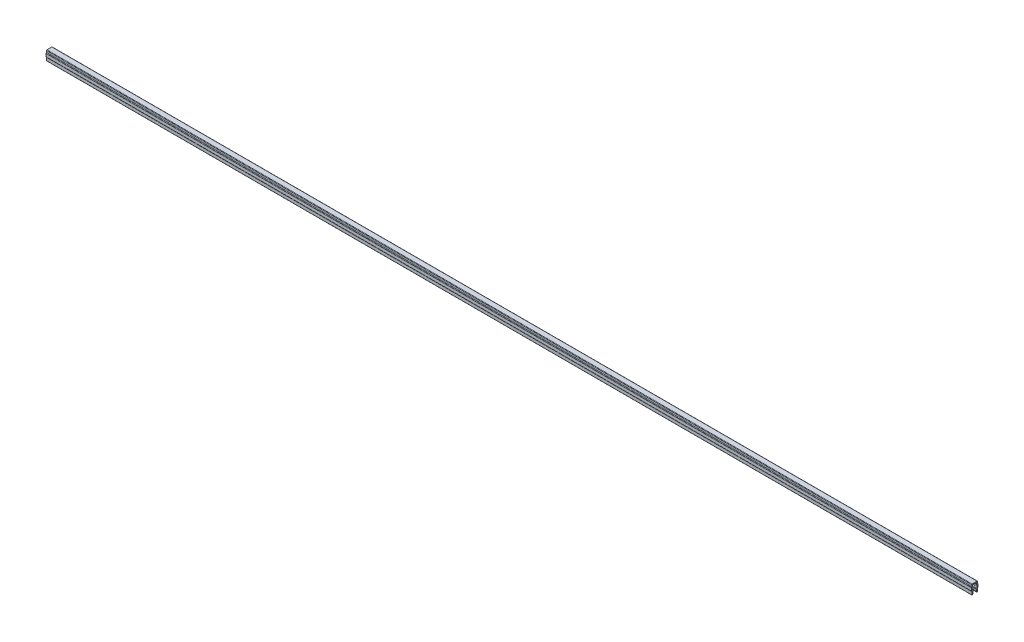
ISO-10303-21;
HEADER;
FILE_DESCRIPTION(('STEP AP214'),'2;1');
FILE_NAME('part.step','',(''),(''),'','','');
FILE_SCHEMA(('AUTOMOTIVE_DESIGN { 1 0 10303 214 1 1 1 1 }'));
ENDSEC;
DATA;
#1=APPLICATION_CONTEXT('core data for automotive mechanical design processes');
#2=APPLICATION_PROTOCOL_DEFINITION('international standard','automotive_design',2000,#1);
#3=PRODUCT_CONTEXT('',#1,'mechanical');
#4=PRODUCT('Part','Part','',(#3));
#5=PRODUCT_RELATED_PRODUCT_CATEGORY('part','',(#4));
#6=PRODUCT_DEFINITION_FORMATION('','',#4);
#7=PRODUCT_DEFINITION_CONTEXT('part definition',#1,'design');
#8=PRODUCT_DEFINITION('design','',#6,#7);
#9=PRODUCT_DEFINITION_SHAPE('','',#8);
#10=(LENGTH_UNIT() NAMED_UNIT(*) SI_UNIT(.MILLI.,.METRE.));
#11=(NAMED_UNIT(*) PLANE_ANGLE_UNIT() SI_UNIT($,.RADIAN.));
#12=(NAMED_UNIT(*) SI_UNIT($,.STERADIAN.) SOLID_ANGLE_UNIT());
#13=UNCERTAINTY_MEASURE_WITH_UNIT(LENGTH_MEASURE(1.E-05),#10,'distance_accuracy_value','');
#14=(GEOMETRIC_REPRESENTATION_CONTEXT(3) GLOBAL_UNCERTAINTY_ASSIGNED_CONTEXT((#13)) GLOBAL_UNIT_ASSIGNED_CONTEXT((#10,
#11,#12)) REPRESENTATION_CONTEXT('',''));
#15=CARTESIAN_POINT('',(0.,0.,0.));
#16=DIRECTION('',(0.,0.,1.));
#17=DIRECTION('',(1.,0.,0.));
#18=AXIS2_PLACEMENT_3D('',#15,#16,#17);
#19=CARTESIAN_POINT('',(1000.,-10.0493903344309,2.71642404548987));
#20=DIRECTION('',(-1.,0.,0.));
#21=DIRECTION('',(0.,0.,1.));
#22=AXIS2_PLACEMENT_3D('',#19,#20,#21);
#23=CYLINDRICAL_SURFACE('',#22,0.300000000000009);
#24=CARTESIAN_POINT('',(0.,-10.0493903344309,2.71642404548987));
#25=DIRECTION('',(1.,0.,0.));
#26=DIRECTION('',(0.,0.,-1.));
#27=AXIS2_PLACEMENT_3D('',#24,#25,#26);
#28=CIRCLE('',#27,0.300000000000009);
#29=CARTESIAN_POINT('',(0.,-10.0493903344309,3.01642404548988));
#30=VERTEX_POINT('',#29);
#31=CARTESIAN_POINT('',(0.,-10.3493903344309,2.71642404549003));
#32=VERTEX_POINT('',#31);
#33=EDGE_CURVE('E359',#30,#32,#28,.T.);
#34=ORIENTED_EDGE('',*,*,#33,.T.);
#35=DIRECTION('',(-1.,0.,0.));
#36=VECTOR('',#35,1.);
#37=CARTESIAN_POINT('',(1000.,-10.3493903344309,2.71642404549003));
#38=LINE('',#37,#36);
#39=CARTESIAN_POINT('',(1000.,-10.3493903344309,2.71642404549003));
#40=VERTEX_POINT('',#39);
#41=EDGE_CURVE('E11',#40,#32,#38,.T.);
#42=ORIENTED_EDGE('',*,*,#41,.F.);
#43=CARTESIAN_POINT('',(1000.,-10.0493903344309,2.71642404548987));
#44=DIRECTION('',(1.,0.,0.));
#45=DIRECTION('',(0.,0.,-1.));
#46=AXIS2_PLACEMENT_3D('',#43,#44,#45);
#47=CIRCLE('',#46,0.300000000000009);
#48=CARTESIAN_POINT('',(1000.,-10.0493903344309,3.01642404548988));
#49=VERTEX_POINT('',#48);
#50=EDGE_CURVE('E449',#49,#40,#47,.T.);
#51=ORIENTED_EDGE('',*,*,#50,.F.);
#52=DIRECTION('',(-1.,0.,0.));
#53=VECTOR('',#52,1.);
#54=CARTESIAN_POINT('',(1000.,-10.0493903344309,3.01642404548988));
#55=LINE('',#54,#53);
#56=EDGE_CURVE('E355',#49,#30,#55,.T.);
#57=ORIENTED_EDGE('',*,*,#56,.T.);
#58=EDGE_LOOP('',(#34,#42,#51,#57));
#59=FACE_BOUND('',#58,.T.);
#60=ADVANCED_FACE('F35',(#59),#23,.T.);
#61=CARTESIAN_POINT('',(1000.,-10.3493903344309,2.51642404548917));
#62=DIRECTION('',(0.,1.,0.));
#63=DIRECTION('',(0.,0.,1.));
#64=AXIS2_PLACEMENT_3D('',#61,#62,#63);
#65=PLANE('',#64);
#66=DIRECTION('',(0.,0.,-1.));
#67=VECTOR('',#66,1.);
#68=CARTESIAN_POINT('',(0.,-10.3493903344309,2.51642404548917));
#69=LINE('',#68,#67);
#70=CARTESIAN_POINT('',(0.,-10.3493903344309,2.51642404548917));
#71=VERTEX_POINT('',#70);
#72=EDGE_CURVE('E362',#32,#71,#69,.T.);
#73=ORIENTED_EDGE('',*,*,#72,.T.);
#74=DIRECTION('',(-1.,0.,0.));
#75=VECTOR('',#74,1.);
#76=CARTESIAN_POINT('',(1000.,-10.3493903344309,2.51642404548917));
#77=LINE('',#76,#75);
#78=CARTESIAN_POINT('',(1000.,-10.3493903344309,2.51642404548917));
#79=VERTEX_POINT('',#78);
#80=EDGE_CURVE('E43',#79,#71,#77,.T.);
#81=ORIENTED_EDGE('',*,*,#80,.F.);
#82=DIRECTION('',(0.,0.,-1.));
#83=VECTOR('',#82,1.);
#84=CARTESIAN_POINT('',(1000.,-10.3493903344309,2.51642404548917));
#85=LINE('',#84,#83);
#86=EDGE_CURVE('E208',#40,#79,#85,.T.);
#87=ORIENTED_EDGE('',*,*,#86,.F.);
#88=ORIENTED_EDGE('',*,*,#41,.T.);
#89=EDGE_LOOP('',(#73,#81,#87,#88));
#90=FACE_BOUND('',#89,.T.);
#91=ADVANCED_FACE('F697',(#90),#65,.F.);
#92=CARTESIAN_POINT('',(1000.,-9.4833649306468,2.01642404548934));
#93=DIRECTION('',(0.,0.5,0.866025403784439));
#94=DIRECTION('',(0.,-0.866025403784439,0.5));
#95=AXIS2_PLACEMENT_3D('',#92,#93,#94);
#96=PLANE('',#95);
#97=DIRECTION('',(0.,0.866025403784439,-0.5));
#98=VECTOR('',#97,1.);
#99=CARTESIAN_POINT('',(0.,-9.4833649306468,2.01642404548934));
#100=LINE('',#99,#98);
#101=CARTESIAN_POINT('',(0.,-9.4833649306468,2.01642404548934));
#102=VERTEX_POINT('',#101);
#103=EDGE_CURVE('E364',#71,#102,#100,.T.);
#104=ORIENTED_EDGE('',*,*,#103,.T.);
#105=DIRECTION('',(-1.,0.,0.));
#106=VECTOR('',#105,1.);
#107=CARTESIAN_POINT('',(1000.,-9.4833649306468,2.01642404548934));
#108=LINE('',#107,#106);
#109=CARTESIAN_POINT('',(1000.,-9.4833649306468,2.01642404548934));
#110=VERTEX_POINT('',#109);
#111=EDGE_CURVE('E570',#110,#102,#108,.T.);
#112=ORIENTED_EDGE('',*,*,#111,.F.);
#113=DIRECTION('',(0.,0.866025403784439,-0.5));
#114=VECTOR('',#113,1.);
#115=CARTESIAN_POINT('',(1000.,-9.4833649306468,2.01642404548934));
#116=LINE('',#115,#114);
#117=EDGE_CURVE('E578',#79,#110,#116,.T.);
#118=ORIENTED_EDGE('',*,*,#117,.F.);
#119=ORIENTED_EDGE('',*,*,#80,.T.);
#120=EDGE_LOOP('',(#104,#112,#118,#119));
#121=FACE_BOUND('',#120,.T.);
#122=ADVANCED_FACE('F576',(#121),#96,.F.);
#123=CARTESIAN_POINT('',(1000.,-9.4833649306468,2.01642404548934));
#124=DIRECTION('',(0.,0.,1.));
#125=DIRECTION('',(1.,0.,0.));
#126=AXIS2_PLACEMENT_3D('',#123,#124,#125);
#127=PLANE('',#126);
#128=DIRECTION('',(0.,1.,0.));
#129=VECTOR('',#128,1.);
#130=CARTESIAN_POINT('',(0.,-9.4833649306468,2.01642404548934));
#131=LINE('',#130,#129);
#132=CARTESIAN_POINT('',(0.,-7.41548419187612,2.01642404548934));
#133=VERTEX_POINT('',#132);
#134=EDGE_CURVE('E366',#102,#133,#131,.T.);
#135=ORIENTED_EDGE('',*,*,#134,.T.);
#136=DIRECTION('',(-1.,0.,0.));
#137=VECTOR('',#136,1.);
#138=CARTESIAN_POINT('',(1000.,-7.41548419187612,2.01642404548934));
#139=LINE('',#138,#137);
#140=CARTESIAN_POINT('',(1000.,-7.41548419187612,2.01642404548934));
#141=VERTEX_POINT('',#140);
#142=EDGE_CURVE('E567',#141,#133,#139,.T.);
#143=ORIENTED_EDGE('',*,*,#142,.F.);
#144=DIRECTION('',(0.,1.,0.));
#145=VECTOR('',#144,1.);
#146=CARTESIAN_POINT('',(1000.,-9.4833649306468,2.01642404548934));
#147=LINE('',#146,#145);
#148=EDGE_CURVE('E596',#110,#141,#147,.T.);
#149=ORIENTED_EDGE('',*,*,#148,.F.);
#150=ORIENTED_EDGE('',*,*,#111,.T.);
#151=EDGE_LOOP('',(#135,#143,#149,#150));
#152=FACE_BOUND('',#151,.T.);
#153=ADVANCED_FACE('F587',(#152),#127,.F.);
#154=CARTESIAN_POINT('',(1000.,-7.41548419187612,1.51642404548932));
#155=DIRECTION('',(-1.,0.,0.));
#156=DIRECTION('',(0.,0.,1.));
#157=AXIS2_PLACEMENT_3D('',#154,#155,#156);
#158=CYLINDRICAL_SURFACE('',#157,0.500000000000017);
#159=CARTESIAN_POINT('',(0.,-7.41548419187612,1.51642404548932));
#160=DIRECTION('',(-1.,0.,0.));
#161=DIRECTION('',(0.,0.,-1.));
#162=AXIS2_PLACEMENT_3D('',#159,#160,#161);
#163=CIRCLE('',#162,0.500000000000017);
#164=CARTESIAN_POINT('',(0.,-7.03246197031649,1.83781785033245));
#165=VERTEX_POINT('',#164);
#166=EDGE_CURVE('E368',#133,#165,#163,.T.);
#167=ORIENTED_EDGE('',*,*,#166,.T.);
#168=DIRECTION('',(-1.,0.,0.));
#169=VECTOR('',#168,1.);
#170=CARTESIAN_POINT('',(1000.,-7.03246197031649,1.83781785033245));
#171=LINE('',#170,#169);
#172=CARTESIAN_POINT('',(1000.,-7.03246197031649,1.83781785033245));
#173=VERTEX_POINT('',#172);
#174=EDGE_CURVE('E564',#173,#165,#171,.T.);
#175=ORIENTED_EDGE('',*,*,#174,.F.);
#176=CARTESIAN_POINT('',(1000.,-7.41548419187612,1.51642404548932));
#177=DIRECTION('',(-1.,0.,0.));
#178=DIRECTION('',(0.,0.,-1.));
#179=AXIS2_PLACEMENT_3D('',#176,#177,#178);
#180=CIRCLE('',#179,0.500000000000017);
#181=EDGE_CURVE('E593',#141,#173,#180,.T.);
#182=ORIENTED_EDGE('',*,*,#181,.F.);
#183=ORIENTED_EDGE('',*,*,#142,.T.);
#184=EDGE_LOOP('',(#167,#175,#182,#183));
#185=FACE_BOUND('',#184,.T.);
#186=ADVANCED_FACE('F591',(#185),#158,.F.);
#187=CARTESIAN_POINT('',(1000.,-6.24271892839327,0.896638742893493));
#188=DIRECTION('',(0.,0.766044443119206,0.642787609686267));
#189=DIRECTION('',(0.,-0.642787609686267,0.766044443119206));
#190=AXIS2_PLACEMENT_3D('',#187,#188,#189);
#191=PLANE('',#190);
#192=DIRECTION('',(0.,0.642787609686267,-0.766044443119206));
#193=VECTOR('',#192,1.);
#194=CARTESIAN_POINT('',(0.,-6.24271892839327,0.896638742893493));
#195=LINE('',#194,#193);
#196=CARTESIAN_POINT('',(0.,-6.24271892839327,0.896638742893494));
#197=VERTEX_POINT('',#196);
#198=EDGE_CURVE('E370',#165,#197,#195,.T.);
#199=ORIENTED_EDGE('',*,*,#198,.T.);
#200=DIRECTION('',(-1.,0.,0.));
#201=VECTOR('',#200,1.);
#202=CARTESIAN_POINT('',(1000.,-6.24271892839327,0.896638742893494));
#203=LINE('',#202,#201);
#204=CARTESIAN_POINT('',(1000.,-6.24271892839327,0.896638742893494));
#205=VERTEX_POINT('',#204);
#206=EDGE_CURVE('E561',#205,#197,#203,.T.);
#207=ORIENTED_EDGE('',*,*,#206,.F.);
#208=DIRECTION('',(0.,0.642787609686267,-0.766044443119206));
#209=VECTOR('',#208,1.);
#210=CARTESIAN_POINT('',(1000.,-6.24271892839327,0.896638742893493));
#211=LINE('',#210,#209);
#212=EDGE_CURVE('E595',#173,#205,#211,.T.);
#213=ORIENTED_EDGE('',*,*,#212,.F.);
#214=ORIENTED_EDGE('',*,*,#174,.T.);
#215=EDGE_LOOP('',(#199,#207,#213,#214));
#216=FACE_BOUND('',#215,.T.);
#217=ADVANCED_FACE('F710',(#216),#191,.F.);
#218=CARTESIAN_POINT('',(1000.,-6.08951003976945,1.02519626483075));
#219=DIRECTION('',(-1.,0.,0.));
#220=DIRECTION('',(0.,0.,1.));
#221=AXIS2_PLACEMENT_3D('',#218,#219,#220);
#222=CYLINDRICAL_SURFACE('',#221,0.199999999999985);
#223=CARTESIAN_POINT('',(0.,-6.08951003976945,1.02519626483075));
#224=DIRECTION('',(1.,0.,0.));
#225=DIRECTION('',(0.,0.,-1.));
#226=AXIS2_PLACEMENT_3D('',#223,#224,#225);
#227=CIRCLE('',#226,0.199999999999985);
#228=CARTESIAN_POINT('',(0.,-5.88951003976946,1.02519626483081));
#229=VERTEX_POINT('',#228);
#230=EDGE_CURVE('E372',#197,#229,#227,.T.);
#231=ORIENTED_EDGE('',*,*,#230,.T.);
#232=DIRECTION('',(-1.,0.,0.));
#233=VECTOR('',#232,1.);
#234=CARTESIAN_POINT('',(1000.,-5.88951003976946,1.02519626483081));
#235=LINE('',#234,#233);
#236=CARTESIAN_POINT('',(1000.,-5.88951003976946,1.02519626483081));
#237=VERTEX_POINT('',#236);
#238=EDGE_CURVE('E558',#237,#229,#235,.T.);
#239=ORIENTED_EDGE('',*,*,#238,.F.);
#240=CARTESIAN_POINT('',(1000.,-6.08951003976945,1.02519626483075));
#241=DIRECTION('',(1.,0.,0.));
#242=DIRECTION('',(0.,0.,-1.));
#243=AXIS2_PLACEMENT_3D('',#240,#241,#242);
#244=CIRCLE('',#243,0.199999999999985);
#245=EDGE_CURVE('E598',#205,#237,#244,.T.);
#246=ORIENTED_EDGE('',*,*,#245,.F.);
#247=ORIENTED_EDGE('',*,*,#206,.T.);
#248=EDGE_LOOP('',(#231,#239,#246,#247));
#249=FACE_BOUND('',#248,.T.);
#250=ADVANCED_FACE('F713',(#249),#222,.T.);
#251=CARTESIAN_POINT('',(1000.,-5.88951003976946,1.8164240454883));
#252=DIRECTION('',(0.,-1.,0.));
#253=DIRECTION('',(0.,0.,-1.));
#254=AXIS2_PLACEMENT_3D('',#251,#252,#253);
#255=PLANE('',#254);
#256=DIRECTION('',(0.,0.,1.));
#257=VECTOR('',#256,1.);
#258=CARTESIAN_POINT('',(0.,-5.88951003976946,1.8164240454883));
#259=LINE('',#258,#257);
#260=CARTESIAN_POINT('',(0.,-5.88951003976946,1.8164240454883));
#261=VERTEX_POINT('',#260);
#262=EDGE_CURVE('E374',#229,#261,#259,.T.);
#263=ORIENTED_EDGE('',*,*,#262,.T.);
#264=DIRECTION('',(-1.,0.,0.));
#265=VECTOR('',#264,1.);
#266=CARTESIAN_POINT('',(1000.,-5.88951003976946,1.8164240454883));
#267=LINE('',#266,#265);
#268=CARTESIAN_POINT('',(1000.,-5.88951003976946,1.8164240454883));
#269=VERTEX_POINT('',#268);
#270=EDGE_CURVE('E555',#269,#261,#267,.T.);
#271=ORIENTED_EDGE('',*,*,#270,.F.);
#272=DIRECTION('',(0.,0.,1.));
#273=VECTOR('',#272,1.);
#274=CARTESIAN_POINT('',(1000.,-5.88951003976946,1.8164240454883));
#275=LINE('',#274,#273);
#276=EDGE_CURVE('E604',#237,#269,#275,.T.);
#277=ORIENTED_EDGE('',*,*,#276,.F.);
#278=ORIENTED_EDGE('',*,*,#238,.T.);
#279=EDGE_LOOP('',(#263,#271,#277,#278));
#280=FACE_BOUND('',#279,.T.);
#281=ADVANCED_FACE('F717',(#280),#255,.F.);
#282=CARTESIAN_POINT('',(1000.,-5.08951003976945,1.81642404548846));
#283=DIRECTION('',(-1.,0.,0.));
#284=DIRECTION('',(0.,0.,1.));
#285=AXIS2_PLACEMENT_3D('',#282,#283,#284);
#286=CYLINDRICAL_SURFACE('',#285,0.800000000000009);
#287=CARTESIAN_POINT('',(0.,-5.08951003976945,1.81642404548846));
#288=DIRECTION('',(-1.,0.,0.));
#289=DIRECTION('',(0.,0.,-1.));
#290=AXIS2_PLACEMENT_3D('',#287,#288,#289);
#291=CIRCLE('',#290,0.800000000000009);
#292=CARTESIAN_POINT('',(0.,-5.08951003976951,2.61642404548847));
#293=VERTEX_POINT('',#292);
#294=EDGE_CURVE('E376',#261,#293,#291,.T.);
#295=ORIENTED_EDGE('',*,*,#294,.T.);
#296=DIRECTION('',(-1.,0.,0.));
#297=VECTOR('',#296,1.);
#298=CARTESIAN_POINT('',(1000.,-5.08951003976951,2.61642404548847));
#299=LINE('',#298,#297);
#300=CARTESIAN_POINT('',(1000.,-5.08951003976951,2.61642404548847));
#301=VERTEX_POINT('',#300);
#302=EDGE_CURVE('E552',#301,#293,#299,.T.);
#303=ORIENTED_EDGE('',*,*,#302,.F.);
#304=CARTESIAN_POINT('',(1000.,-5.08951003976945,1.81642404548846));
#305=DIRECTION('',(-1.,0.,0.));
#306=DIRECTION('',(0.,0.,-1.));
#307=AXIS2_PLACEMENT_3D('',#304,#305,#306);
#308=CIRCLE('',#307,0.800000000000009);
#309=EDGE_CURVE('E606',#269,#301,#308,.T.);
#310=ORIENTED_EDGE('',*,*,#309,.F.);
#311=ORIENTED_EDGE('',*,*,#270,.T.);
#312=EDGE_LOOP('',(#295,#303,#310,#311));
#313=FACE_BOUND('',#312,.T.);
#314=ADVANCED_FACE('F721',(#313),#286,.F.);
#315=CARTESIAN_POINT('',(1000.,-5.08951003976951,2.61642404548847));
#316=DIRECTION('',(0.,0.,1.));
#317=DIRECTION('',(1.,0.,0.));
#318=AXIS2_PLACEMENT_3D('',#315,#316,#317);
#319=PLANE('',#318);
#320=DIRECTION('',(0.,1.,0.));
#321=VECTOR('',#320,1.);
#322=CARTESIAN_POINT('',(0.,-5.08951003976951,2.61642404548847));
#323=LINE('',#322,#321);
#324=CARTESIAN_POINT('',(0.,-3.63960171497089,2.61642404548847));
#325=VERTEX_POINT('',#324);
#326=EDGE_CURVE('E378',#293,#325,#323,.T.);
#327=ORIENTED_EDGE('',*,*,#326,.T.);
#328=DIRECTION('',(-1.,0.,0.));
#329=VECTOR('',#328,1.);
#330=CARTESIAN_POINT('',(1000.,-3.63960171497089,2.61642404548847));
#331=LINE('',#330,#329);
#332=CARTESIAN_POINT('',(1000.,-3.63960171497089,2.61642404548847));
#333=VERTEX_POINT('',#332);
#334=EDGE_CURVE('E549',#333,#325,#331,.T.);
#335=ORIENTED_EDGE('',*,*,#334,.F.);
#336=DIRECTION('',(0.,1.,0.));
#337=VECTOR('',#336,1.);
#338=CARTESIAN_POINT('',(1000.,-5.08951003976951,2.61642404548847));
#339=LINE('',#338,#337);
#340=EDGE_CURVE('E608',#301,#333,#339,.T.);
#341=ORIENTED_EDGE('',*,*,#340,.F.);
#342=ORIENTED_EDGE('',*,*,#302,.T.);
#343=EDGE_LOOP('',(#327,#335,#341,#342));
#344=FACE_BOUND('',#343,.T.);
#345=ADVANCED_FACE('F725',(#344),#319,.F.);
#346=CARTESIAN_POINT('',(1000.,-3.63960171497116,2.1164240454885));
#347=DIRECTION('',(-1.,0.,0.));
#348=DIRECTION('',(0.,0.,1.));
#349=AXIS2_PLACEMENT_3D('',#346,#347,#348);
#350=CYLINDRICAL_SURFACE('',#349,0.499999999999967);
#351=CARTESIAN_POINT('',(0.,-3.63960171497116,2.1164240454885));
#352=DIRECTION('',(-1.,0.,0.));
#353=DIRECTION('',(0.,0.,-1.));
#354=AXIS2_PLACEMENT_3D('',#351,#352,#353);
#355=CIRCLE('',#354,0.499999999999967);
#356=CARTESIAN_POINT('',(0.,-3.20658901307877,2.36642404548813));
#357=VERTEX_POINT('',#356);
#358=EDGE_CURVE('E380',#325,#357,#355,.T.);
#359=ORIENTED_EDGE('',*,*,#358,.T.);
#360=DIRECTION('',(-1.,0.,0.));
#361=VECTOR('',#360,1.);
#362=CARTESIAN_POINT('',(1000.,-3.20658901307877,2.36642404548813));
#363=LINE('',#362,#361);
#364=CARTESIAN_POINT('',(1000.,-3.20658901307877,2.36642404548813));
#365=VERTEX_POINT('',#364);
#366=EDGE_CURVE('E546',#365,#357,#363,.T.);
#367=ORIENTED_EDGE('',*,*,#366,.F.);
#368=CARTESIAN_POINT('',(1000.,-3.63960171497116,2.1164240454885));
#369=DIRECTION('',(-1.,0.,0.));
#370=DIRECTION('',(0.,0.,-1.));
#371=AXIS2_PLACEMENT_3D('',#368,#369,#370);
#372=CIRCLE('',#371,0.499999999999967);
#373=EDGE_CURVE('E610',#333,#365,#372,.T.);
#374=ORIENTED_EDGE('',*,*,#373,.F.);
#375=ORIENTED_EDGE('',*,*,#334,.T.);
#376=EDGE_LOOP('',(#359,#367,#374,#375));
#377=FACE_BOUND('',#376,.T.);
#378=ADVANCED_FACE('F729',(#377),#350,.F.);
#379=CARTESIAN_POINT('',(1000.,-2.77357631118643,2.61642404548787));
#380=DIRECTION('',(-1.,0.,0.));
#381=DIRECTION('',(0.,0.,1.));
#382=AXIS2_PLACEMENT_3D('',#379,#380,#381);
#383=CYLINDRICAL_SURFACE('',#382,0.499999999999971);
#384=CARTESIAN_POINT('',(0.,-2.77357631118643,2.61642404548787));
#385=DIRECTION('',(1.,0.,0.));
#386=DIRECTION('',(0.,0.,-1.));
#387=AXIS2_PLACEMENT_3D('',#384,#385,#386);
#388=CIRCLE('',#387,0.499999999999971);
#389=CARTESIAN_POINT('',(0.,-2.77357631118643,2.1164240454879));
#390=VERTEX_POINT('',#389);
#391=EDGE_CURVE('E382',#357,#390,#388,.T.);
#392=ORIENTED_EDGE('',*,*,#391,.T.);
#393=DIRECTION('',(-1.,0.,0.));
#394=VECTOR('',#393,1.);
#395=CARTESIAN_POINT('',(1000.,-2.77357631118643,2.1164240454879));
#396=LINE('',#395,#394);
#397=CARTESIAN_POINT('',(1000.,-2.77357631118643,2.1164240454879));
#398=VERTEX_POINT('',#397);
#399=EDGE_CURVE('E543',#398,#390,#396,.T.);
#400=ORIENTED_EDGE('',*,*,#399,.F.);
#401=CARTESIAN_POINT('',(1000.,-2.77357631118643,2.61642404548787));
#402=DIRECTION('',(1.,0.,0.));
#403=DIRECTION('',(0.,0.,-1.));
#404=AXIS2_PLACEMENT_3D('',#401,#402,#403);
#405=CIRCLE('',#404,0.499999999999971);
#406=EDGE_CURVE('E612',#365,#398,#405,.T.);
#407=ORIENTED_EDGE('',*,*,#406,.F.);
#408=ORIENTED_EDGE('',*,*,#366,.T.);
#409=EDGE_LOOP('',(#392,#400,#407,#408));
#410=FACE_BOUND('',#409,.T.);
#411=ADVANCED_FACE('F733',(#410),#383,.T.);
#412=CARTESIAN_POINT('',(1000.,-2.77357631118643,2.1164240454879));
#413=DIRECTION('',(0.,0.,1.));
#414=DIRECTION('',(1.,0.,0.));
#415=AXIS2_PLACEMENT_3D('',#412,#413,#414);
#416=PLANE('',#415);
#417=DIRECTION('',(0.,1.,0.));
#418=VECTOR('',#417,1.);
#419=CARTESIAN_POINT('',(0.,-2.77357631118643,2.1164240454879));
#420=LINE('',#419,#418);
#421=CARTESIAN_POINT('',(0.,-1.5000000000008,2.1164240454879));
#422=VERTEX_POINT('',#421);
#423=EDGE_CURVE('E384',#390,#422,#420,.T.);
#424=ORIENTED_EDGE('',*,*,#423,.T.);
#425=DIRECTION('',(-1.,0.,0.));
#426=VECTOR('',#425,1.);
#427=CARTESIAN_POINT('',(1000.,-1.5000000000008,2.1164240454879));
#428=LINE('',#427,#426);
#429=CARTESIAN_POINT('',(1000.,-1.5000000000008,2.1164240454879));
#430=VERTEX_POINT('',#429);
#431=EDGE_CURVE('E540',#430,#422,#428,.T.);
#432=ORIENTED_EDGE('',*,*,#431,.F.);
#433=DIRECTION('',(0.,1.,0.));
#434=VECTOR('',#433,1.);
#435=CARTESIAN_POINT('',(1000.,-2.77357631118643,2.1164240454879));
#436=LINE('',#435,#434);
#437=EDGE_CURVE('E614',#398,#430,#436,.T.);
#438=ORIENTED_EDGE('',*,*,#437,.F.);
#439=ORIENTED_EDGE('',*,*,#399,.T.);
#440=EDGE_LOOP('',(#424,#432,#438,#439));
#441=FACE_BOUND('',#440,.T.);
#442=ADVANCED_FACE('F737',(#441),#416,.F.);
#443=CARTESIAN_POINT('',(1000.,-1.50000000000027,1.61642404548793));
#444=DIRECTION('',(-1.,0.,0.));
#445=DIRECTION('',(0.,0.,1.));
#446=AXIS2_PLACEMENT_3D('',#443,#444,#445);
#447=CYLINDRICAL_SURFACE('',#446,0.499999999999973);
#448=CARTESIAN_POINT('',(0.,-1.50000000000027,1.61642404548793));
#449=DIRECTION('',(-1.,0.,0.));
#450=DIRECTION('',(0.,0.,-1.));
#451=AXIS2_PLACEMENT_3D('',#448,#449,#450);
#452=CIRCLE('',#451,0.499999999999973);
#453=CARTESIAN_POINT('',(0.,-1.0000000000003,1.61642404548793));
#454=VERTEX_POINT('',#453);
#455=EDGE_CURVE('E386',#422,#454,#452,.T.);
#456=ORIENTED_EDGE('',*,*,#455,.T.);
#457=DIRECTION('',(-1.,0.,0.));
#458=VECTOR('',#457,1.);
#459=CARTESIAN_POINT('',(1000.,-1.0000000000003,1.61642404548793));
#460=LINE('',#459,#458);
#461=CARTESIAN_POINT('',(1000.,-1.0000000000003,1.61642404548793));
#462=VERTEX_POINT('',#461);
#463=EDGE_CURVE('E537',#462,#454,#460,.T.);
#464=ORIENTED_EDGE('',*,*,#463,.F.);
#465=CARTESIAN_POINT('',(1000.,-1.50000000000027,1.61642404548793));
#466=DIRECTION('',(-1.,0.,0.));
#467=DIRECTION('',(0.,0.,-1.));
#468=AXIS2_PLACEMENT_3D('',#465,#466,#467);
#469=CIRCLE('',#468,0.499999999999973);
#470=EDGE_CURVE('E616',#430,#462,#469,.T.);
#471=ORIENTED_EDGE('',*,*,#470,.F.);
#472=ORIENTED_EDGE('',*,*,#431,.T.);
#473=EDGE_LOOP('',(#456,#464,#471,#472));
#474=FACE_BOUND('',#473,.T.);
#475=ADVANCED_FACE('F741',(#474),#447,.F.);
#476=CARTESIAN_POINT('',(1000.,-1.0000000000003,-1.61642404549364));
#477=DIRECTION('',(0.,1.,0.));
#478=DIRECTION('',(0.,0.,1.));
#479=AXIS2_PLACEMENT_3D('',#476,#477,#478);
#480=PLANE('',#479);
#481=DIRECTION('',(0.,0.,-1.));
#482=VECTOR('',#481,1.);
#483=CARTESIAN_POINT('',(0.,-1.0000000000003,-1.61642404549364));
#484=LINE('',#483,#482);
#485=CARTESIAN_POINT('',(0.,-1.0000000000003,-1.61642404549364));
#486=VERTEX_POINT('',#485);
#487=EDGE_CURVE('E388',#454,#486,#484,.T.);
#488=ORIENTED_EDGE('',*,*,#487,.T.);
#489=DIRECTION('',(-1.,0.,0.));
#490=VECTOR('',#489,1.);
#491=CARTESIAN_POINT('',(1000.,-1.0000000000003,-1.61642404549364));
#492=LINE('',#491,#490);
#493=CARTESIAN_POINT('',(1000.,-1.0000000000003,-1.61642404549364));
#494=VERTEX_POINT('',#493);
#495=EDGE_CURVE('E534',#494,#486,#492,.T.);
#496=ORIENTED_EDGE('',*,*,#495,.F.);
#497=DIRECTION('',(0.,0.,-1.));
#498=VECTOR('',#497,1.);
#499=CARTESIAN_POINT('',(1000.,-1.0000000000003,-1.61642404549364));
#500=LINE('',#499,#498);
#501=EDGE_CURVE('E618',#462,#494,#500,.T.);
#502=ORIENTED_EDGE('',*,*,#501,.F.);
#503=ORIENTED_EDGE('',*,*,#463,.T.);
#504=EDGE_LOOP('',(#488,#496,#502,#503));
#505=FACE_BOUND('',#504,.T.);
#506=ADVANCED_FACE('F745',(#505),#480,.F.);
#507=CARTESIAN_POINT('',(1000.,-1.50000000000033,-1.61642404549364));
#508=DIRECTION('',(-1.,0.,0.));
#509=DIRECTION('',(0.,0.,1.));
#510=AXIS2_PLACEMENT_3D('',#507,#508,#509);
#511=CYLINDRICAL_SURFACE('',#510,0.500000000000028);
#512=CARTESIAN_POINT('',(0.,-1.50000000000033,-1.61642404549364));
#513=DIRECTION('',(-1.,0.,0.));
#514=DIRECTION('',(0.,0.,-1.));
#515=AXIS2_PLACEMENT_3D('',#512,#513,#514);
#516=CIRCLE('',#515,0.500000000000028);
#517=CARTESIAN_POINT('',(0.,-1.50000000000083,-2.11642404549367));
#518=VERTEX_POINT('',#517);
#519=EDGE_CURVE('E390',#486,#518,#516,.T.);
#520=ORIENTED_EDGE('',*,*,#519,.T.);
#521=DIRECTION('',(-1.,0.,0.));
#522=VECTOR('',#521,1.);
#523=CARTESIAN_POINT('',(1000.,-1.50000000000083,-2.11642404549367));
#524=LINE('',#523,#522);
#525=CARTESIAN_POINT('',(1000.,-1.50000000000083,-2.11642404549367));
#526=VERTEX_POINT('',#525);
#527=EDGE_CURVE('E531',#526,#518,#524,.T.);
#528=ORIENTED_EDGE('',*,*,#527,.F.);
#529=CARTESIAN_POINT('',(1000.,-1.50000000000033,-1.61642404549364));
#530=DIRECTION('',(-1.,0.,0.));
#531=DIRECTION('',(0.,0.,-1.));
#532=AXIS2_PLACEMENT_3D('',#529,#530,#531);
#533=CIRCLE('',#532,0.500000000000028);
#534=EDGE_CURVE('E620',#494,#526,#533,.T.);
#535=ORIENTED_EDGE('',*,*,#534,.F.);
#536=ORIENTED_EDGE('',*,*,#495,.T.);
#537=EDGE_LOOP('',(#520,#528,#535,#536));
#538=FACE_BOUND('',#537,.T.);
#539=ADVANCED_FACE('F749',(#538),#511,.F.);
#540=CARTESIAN_POINT('',(1000.,-2.77357631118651,-2.11642404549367));
#541=DIRECTION('',(0.,0.,-1.));
#542=DIRECTION('',(-1.,0.,0.));
#543=AXIS2_PLACEMENT_3D('',#540,#541,#542);
#544=PLANE('',#543);
#545=DIRECTION('',(0.,-1.,0.));
#546=VECTOR('',#545,1.);
#547=CARTESIAN_POINT('',(0.,-2.77357631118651,-2.11642404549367));
#548=LINE('',#547,#546);
#549=CARTESIAN_POINT('',(0.,-2.77357631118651,-2.11642404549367));
#550=VERTEX_POINT('',#549);
#551=EDGE_CURVE('E392',#518,#550,#548,.T.);
#552=ORIENTED_EDGE('',*,*,#551,.T.);
#553=DIRECTION('',(-1.,0.,0.));
#554=VECTOR('',#553,1.);
#555=CARTESIAN_POINT('',(1000.,-2.77357631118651,-2.11642404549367));
#556=LINE('',#555,#554);
#557=CARTESIAN_POINT('',(1000.,-2.77357631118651,-2.11642404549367));
#558=VERTEX_POINT('',#557);
#559=EDGE_CURVE('E528',#558,#550,#556,.T.);
#560=ORIENTED_EDGE('',*,*,#559,.F.);
#561=DIRECTION('',(0.,-1.,0.));
#562=VECTOR('',#561,1.);
#563=CARTESIAN_POINT('',(1000.,-2.77357631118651,-2.11642404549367));
#564=LINE('',#563,#562);
#565=EDGE_CURVE('E622',#526,#558,#564,.T.);
#566=ORIENTED_EDGE('',*,*,#565,.F.);
#567=ORIENTED_EDGE('',*,*,#527,.T.);
#568=EDGE_LOOP('',(#552,#560,#566,#567));
#569=FACE_BOUND('',#568,.T.);
#570=ADVANCED_FACE('F753',(#569),#544,.F.);
#571=CARTESIAN_POINT('',(1000.,-2.77357631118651,-2.6164240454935));
#572=DIRECTION('',(-1.,0.,0.));
#573=DIRECTION('',(0.,0.,1.));
#574=AXIS2_PLACEMENT_3D('',#571,#572,#573);
#575=CYLINDRICAL_SURFACE('',#574,0.499999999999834);
#576=CARTESIAN_POINT('',(0.,-2.77357631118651,-2.6164240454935));
#577=DIRECTION('',(1.,0.,0.));
#578=DIRECTION('',(0.,0.,-1.));
#579=AXIS2_PLACEMENT_3D('',#576,#577,#578);
#580=CIRCLE('',#579,0.499999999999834);
#581=CARTESIAN_POINT('',(0.,-3.20658901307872,-2.36642404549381));
#582=VERTEX_POINT('',#581);
#583=EDGE_CURVE('E394',#550,#582,#580,.T.);
#584=ORIENTED_EDGE('',*,*,#583,.T.);
#585=DIRECTION('',(-1.,0.,0.));
#586=VECTOR('',#585,1.);
#587=CARTESIAN_POINT('',(1000.,-3.20658901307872,-2.36642404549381));
#588=LINE('',#587,#586);
#589=CARTESIAN_POINT('',(1000.,-3.20658901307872,-2.36642404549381));
#590=VERTEX_POINT('',#589);
#591=EDGE_CURVE('E525',#590,#582,#588,.T.);
#592=ORIENTED_EDGE('',*,*,#591,.F.);
#593=CARTESIAN_POINT('',(1000.,-2.77357631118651,-2.6164240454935));
#594=DIRECTION('',(1.,0.,0.));
#595=DIRECTION('',(0.,0.,-1.));
#596=AXIS2_PLACEMENT_3D('',#593,#594,#595);
#597=CIRCLE('',#596,0.499999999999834);
#598=EDGE_CURVE('E624',#558,#590,#597,.T.);
#599=ORIENTED_EDGE('',*,*,#598,.F.);
#600=ORIENTED_EDGE('',*,*,#559,.T.);
#601=EDGE_LOOP('',(#584,#592,#599,#600));
#602=FACE_BOUND('',#601,.T.);
#603=ADVANCED_FACE('F757',(#602),#575,.T.);
#604=CARTESIAN_POINT('',(1000.,-3.6396017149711,-2.11642404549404));
#605=DIRECTION('',(-1.,0.,0.));
#606=DIRECTION('',(0.,0.,1.));
#607=AXIS2_PLACEMENT_3D('',#604,#605,#606);
#608=CYLINDRICAL_SURFACE('',#607,0.500000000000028);
#609=CARTESIAN_POINT('',(0.,-3.6396017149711,-2.11642404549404));
#610=DIRECTION('',(-1.,0.,0.));
#611=DIRECTION('',(0.,0.,-1.));
#612=AXIS2_PLACEMENT_3D('',#609,#610,#611);
#613=CIRCLE('',#612,0.500000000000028);
#614=CARTESIAN_POINT('',(0.,-3.6396017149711,-2.61642404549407));
#615=VERTEX_POINT('',#614);
#616=EDGE_CURVE('E396',#582,#615,#613,.T.);
#617=ORIENTED_EDGE('',*,*,#616,.T.);
#618=DIRECTION('',(-1.,0.,0.));
#619=VECTOR('',#618,1.);
#620=CARTESIAN_POINT('',(1000.,-3.6396017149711,-2.61642404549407));
#621=LINE('',#620,#619);
#622=CARTESIAN_POINT('',(1000.,-3.6396017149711,-2.61642404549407));
#623=VERTEX_POINT('',#622);
#624=EDGE_CURVE('E522',#623,#615,#621,.T.);
#625=ORIENTED_EDGE('',*,*,#624,.F.);
#626=CARTESIAN_POINT('',(1000.,-3.6396017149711,-2.11642404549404));
#627=DIRECTION('',(-1.,0.,0.));
#628=DIRECTION('',(0.,0.,-1.));
#629=AXIS2_PLACEMENT_3D('',#626,#627,#628);
#630=CIRCLE('',#629,0.500000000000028);
#631=EDGE_CURVE('E626',#590,#623,#630,.T.);
#632=ORIENTED_EDGE('',*,*,#631,.F.);
#633=ORIENTED_EDGE('',*,*,#591,.T.);
#634=EDGE_LOOP('',(#617,#625,#632,#633));
#635=FACE_BOUND('',#634,.T.);
#636=ADVANCED_FACE('F761',(#635),#608,.F.);
#637=CARTESIAN_POINT('',(1000.,-5.08951003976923,-2.61642404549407));
#638=DIRECTION('',(0.,0.,-1.));
#639=DIRECTION('',(-1.,0.,0.));
#640=AXIS2_PLACEMENT_3D('',#637,#638,#639);
#641=PLANE('',#640);
#642=DIRECTION('',(0.,-1.,0.));
#643=VECTOR('',#642,1.);
#644=CARTESIAN_POINT('',(0.,-5.08951003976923,-2.61642404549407));
#645=LINE('',#644,#643);
#646=CARTESIAN_POINT('',(0.,-5.08951003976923,-2.61642404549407));
#647=VERTEX_POINT('',#646);
#648=EDGE_CURVE('E398',#615,#647,#645,.T.);
#649=ORIENTED_EDGE('',*,*,#648,.T.);
#650=DIRECTION('',(-1.,0.,0.));
#651=VECTOR('',#650,1.);
#652=CARTESIAN_POINT('',(1000.,-5.08951003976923,-2.61642404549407));
#653=LINE('',#652,#651);
#654=CARTESIAN_POINT('',(1000.,-5.08951003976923,-2.61642404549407));
#655=VERTEX_POINT('',#654);
#656=EDGE_CURVE('E519',#655,#647,#653,.T.);
#657=ORIENTED_EDGE('',*,*,#656,.F.);
#658=DIRECTION('',(0.,-1.,0.));
#659=VECTOR('',#658,1.);
#660=CARTESIAN_POINT('',(1000.,-5.08951003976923,-2.61642404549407));
#661=LINE('',#660,#659);
#662=EDGE_CURVE('E628',#623,#655,#661,.T.);
#663=ORIENTED_EDGE('',*,*,#662,.F.);
#664=ORIENTED_EDGE('',*,*,#624,.T.);
#665=EDGE_LOOP('',(#649,#657,#663,#664));
#666=FACE_BOUND('',#665,.T.);
#667=ADVANCED_FACE('F765',(#666),#641,.F.);
#668=CARTESIAN_POINT('',(1000.,-5.08951003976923,-1.81642404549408));
#669=DIRECTION('',(-1.,0.,0.));
#670=DIRECTION('',(0.,0.,1.));
#671=AXIS2_PLACEMENT_3D('',#668,#669,#670);
#672=CYLINDRICAL_SURFACE('',#671,0.799999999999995);
#673=CARTESIAN_POINT('',(0.,-5.08951003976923,-1.81642404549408));
#674=DIRECTION('',(-1.,0.,0.));
#675=DIRECTION('',(0.,0.,-1.));
#676=AXIS2_PLACEMENT_3D('',#673,#674,#675);
#677=CIRCLE('',#676,0.799999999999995);
#678=CARTESIAN_POINT('',(0.,-5.88951003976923,-1.81642404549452));
#679=VERTEX_POINT('',#678);
#680=EDGE_CURVE('E400',#647,#679,#677,.T.);
#681=ORIENTED_EDGE('',*,*,#680,.T.);
#682=DIRECTION('',(-1.,0.,0.));
#683=VECTOR('',#682,1.);
#684=CARTESIAN_POINT('',(1000.,-5.88951003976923,-1.81642404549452));
#685=LINE('',#684,#683);
#686=CARTESIAN_POINT('',(1000.,-5.88951003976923,-1.81642404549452));
#687=VERTEX_POINT('',#686);
#688=EDGE_CURVE('E516',#687,#679,#685,.T.);
#689=ORIENTED_EDGE('',*,*,#688,.F.);
#690=CARTESIAN_POINT('',(1000.,-5.08951003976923,-1.81642404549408));
#691=DIRECTION('',(-1.,0.,0.));
#692=DIRECTION('',(0.,0.,-1.));
#693=AXIS2_PLACEMENT_3D('',#690,#691,#692);
#694=CIRCLE('',#693,0.799999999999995);
#695=EDGE_CURVE('E630',#655,#687,#694,.T.);
#696=ORIENTED_EDGE('',*,*,#695,.F.);
#697=ORIENTED_EDGE('',*,*,#656,.T.);
#698=EDGE_LOOP('',(#681,#689,#696,#697));
#699=FACE_BOUND('',#698,.T.);
#700=ADVANCED_FACE('F769',(#699),#672,.F.);
#701=CARTESIAN_POINT('',(1000.,-5.88951003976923,-1.81642404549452));
#702=DIRECTION('',(0.,-1.,0.));
#703=DIRECTION('',(0.,0.,-1.));
#704=AXIS2_PLACEMENT_3D('',#701,#702,#703);
#705=PLANE('',#704);
#706=DIRECTION('',(0.,0.,1.));
#707=VECTOR('',#706,1.);
#708=CARTESIAN_POINT('',(0.,-5.88951003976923,-1.81642404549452));
#709=LINE('',#708,#707);
#710=CARTESIAN_POINT('',(0.,-5.88951003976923,-1.02519626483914));
#711=VERTEX_POINT('',#710);
#712=EDGE_CURVE('E402',#679,#711,#709,.T.);
#713=ORIENTED_EDGE('',*,*,#712,.T.);
#714=DIRECTION('',(-1.,0.,0.));
#715=VECTOR('',#714,1.);
#716=CARTESIAN_POINT('',(1000.,-5.88951003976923,-1.02519626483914));
#717=LINE('',#716,#715);
#718=CARTESIAN_POINT('',(1000.,-5.88951003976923,-1.02519626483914));
#719=VERTEX_POINT('',#718);
#720=EDGE_CURVE('E513',#719,#711,#717,.T.);
#721=ORIENTED_EDGE('',*,*,#720,.F.);
#722=DIRECTION('',(0.,0.,1.));
#723=VECTOR('',#722,1.);
#724=CARTESIAN_POINT('',(1000.,-5.88951003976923,-1.81642404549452));
#725=LINE('',#724,#723);
#726=EDGE_CURVE('E632',#687,#719,#725,.T.);
#727=ORIENTED_EDGE('',*,*,#726,.F.);
#728=ORIENTED_EDGE('',*,*,#688,.T.);
#729=EDGE_LOOP('',(#713,#721,#727,#728));
#730=FACE_BOUND('',#729,.T.);
#731=ADVANCED_FACE('F773',(#730),#705,.F.);
#732=CARTESIAN_POINT('',(1000.,-6.08951003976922,-1.02519626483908));
#733=DIRECTION('',(-1.,0.,0.));
#734=DIRECTION('',(0.,0.,1.));
#735=AXIS2_PLACEMENT_3D('',#732,#733,#734);
#736=CYLINDRICAL_SURFACE('',#735,0.199999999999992);
#737=CARTESIAN_POINT('',(0.,-6.08951003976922,-1.02519626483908));
#738=DIRECTION('',(1.,0.,0.));
#739=DIRECTION('',(0.,0.,-1.));
#740=AXIS2_PLACEMENT_3D('',#737,#738,#739);
#741=CIRCLE('',#740,0.199999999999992);
#742=CARTESIAN_POINT('',(0.,-6.24271892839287,-0.896638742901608));
#743=VERTEX_POINT('',#742);
#744=EDGE_CURVE('E404',#711,#743,#741,.T.);
#745=ORIENTED_EDGE('',*,*,#744,.T.);
#746=DIRECTION('',(-1.,0.,0.));
#747=VECTOR('',#746,1.);
#748=CARTESIAN_POINT('',(1000.,-6.24271892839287,-0.896638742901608));
#749=LINE('',#748,#747);
#750=CARTESIAN_POINT('',(1000.,-6.24271892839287,-0.896638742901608));
#751=VERTEX_POINT('',#750);
#752=EDGE_CURVE('E510',#751,#743,#749,.T.);
#753=ORIENTED_EDGE('',*,*,#752,.F.);
#754=CARTESIAN_POINT('',(1000.,-6.08951003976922,-1.02519626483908));
#755=DIRECTION('',(1.,0.,0.));
#756=DIRECTION('',(0.,0.,-1.));
#757=AXIS2_PLACEMENT_3D('',#754,#755,#756);
#758=CIRCLE('',#757,0.199999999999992);
#759=EDGE_CURVE('E634',#719,#751,#758,.T.);
#760=ORIENTED_EDGE('',*,*,#759,.F.);
#761=ORIENTED_EDGE('',*,*,#720,.T.);
#762=EDGE_LOOP('',(#745,#753,#760,#761));
#763=FACE_BOUND('',#762,.T.);
#764=ADVANCED_FACE('F777',(#763),#736,.T.);
#765=CARTESIAN_POINT('',(1000.,-6.24271892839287,-0.896638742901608));
#766=DIRECTION('',(0.,0.766044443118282,-0.642787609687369));
#767=DIRECTION('',(0.,0.642787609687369,0.766044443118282));
#768=AXIS2_PLACEMENT_3D('',#765,#766,#767);
#769=PLANE('',#768);
#770=DIRECTION('',(0.,-0.642787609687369,-0.766044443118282));
#771=VECTOR('',#770,1.);
#772=CARTESIAN_POINT('',(0.,-6.24271892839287,-0.896638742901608));
#773=LINE('',#772,#771);
#774=CARTESIAN_POINT('',(0.,-7.03246197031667,-1.83781785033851));
#775=VERTEX_POINT('',#774);
#776=EDGE_CURVE('E406',#743,#775,#773,.T.);
#777=ORIENTED_EDGE('',*,*,#776,.T.);
#778=DIRECTION('',(-1.,0.,0.));
#779=VECTOR('',#778,1.);
#780=CARTESIAN_POINT('',(1000.,-7.03246197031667,-1.83781785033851));
#781=LINE('',#780,#779);
#782=CARTESIAN_POINT('',(1000.,-7.03246197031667,-1.83781785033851));
#783=VERTEX_POINT('',#782);
#784=EDGE_CURVE('E507',#783,#775,#781,.T.);
#785=ORIENTED_EDGE('',*,*,#784,.F.);
#786=DIRECTION('',(0.,-0.642787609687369,-0.766044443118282));
#787=VECTOR('',#786,1.);
#788=CARTESIAN_POINT('',(1000.,-6.24271892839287,-0.896638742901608));
#789=LINE('',#788,#787);
#790=EDGE_CURVE('E636',#751,#783,#789,.T.);
#791=ORIENTED_EDGE('',*,*,#790,.F.);
#792=ORIENTED_EDGE('',*,*,#752,.T.);
#793=EDGE_LOOP('',(#777,#785,#791,#792));
#794=FACE_BOUND('',#793,.T.);
#795=ADVANCED_FACE('F781',(#794),#769,.F.);
#796=CARTESIAN_POINT('',(1000.,-7.41548419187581,-1.51642404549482));
#797=DIRECTION('',(-1.,0.,0.));
#798=DIRECTION('',(0.,0.,1.));
#799=AXIS2_PLACEMENT_3D('',#796,#797,#798);
#800=CYLINDRICAL_SURFACE('',#799,0.500000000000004);
#801=CARTESIAN_POINT('',(0.,-7.41548419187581,-1.51642404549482));
#802=DIRECTION('',(-1.,0.,0.));
#803=DIRECTION('',(0.,0.,-1.));
#804=AXIS2_PLACEMENT_3D('',#801,#802,#803);
#805=CIRCLE('',#804,0.500000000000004);
#806=CARTESIAN_POINT('',(0.,-7.41548419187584,-2.01642404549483));
#807=VERTEX_POINT('',#806);
#808=EDGE_CURVE('E408',#775,#807,#805,.T.);
#809=ORIENTED_EDGE('',*,*,#808,.T.);
#810=DIRECTION('',(-1.,0.,0.));
#811=VECTOR('',#810,1.);
#812=CARTESIAN_POINT('',(1000.,-7.41548419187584,-2.01642404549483));
#813=LINE('',#812,#811);
#814=CARTESIAN_POINT('',(1000.,-7.41548419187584,-2.01642404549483));
#815=VERTEX_POINT('',#814);
#816=EDGE_CURVE('E504',#815,#807,#813,.T.);
#817=ORIENTED_EDGE('',*,*,#816,.F.);
#818=CARTESIAN_POINT('',(1000.,-7.41548419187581,-1.51642404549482));
#819=DIRECTION('',(-1.,0.,0.));
#820=DIRECTION('',(0.,0.,-1.));
#821=AXIS2_PLACEMENT_3D('',#818,#819,#820);
#822=CIRCLE('',#821,0.500000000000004);
#823=EDGE_CURVE('E638',#783,#815,#822,.T.);
#824=ORIENTED_EDGE('',*,*,#823,.F.);
#825=ORIENTED_EDGE('',*,*,#784,.T.);
#826=EDGE_LOOP('',(#809,#817,#824,#825));
#827=FACE_BOUND('',#826,.T.);
#828=ADVANCED_FACE('F785',(#827),#800,.F.);
#829=CARTESIAN_POINT('',(1000.,-9.4833649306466,-2.01642404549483));
#830=DIRECTION('',(0.,0.,-1.));
#831=DIRECTION('',(-1.,0.,0.));
#832=AXIS2_PLACEMENT_3D('',#829,#830,#831);
#833=PLANE('',#832);
#834=DIRECTION('',(0.,-1.,0.));
#835=VECTOR('',#834,1.);
#836=CARTESIAN_POINT('',(0.,-9.4833649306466,-2.01642404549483));
#837=LINE('',#836,#835);
#838=CARTESIAN_POINT('',(0.,-9.4833649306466,-2.01642404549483));
#839=VERTEX_POINT('',#838);
#840=EDGE_CURVE('E410',#807,#839,#837,.T.);
#841=ORIENTED_EDGE('',*,*,#840,.T.);
#842=DIRECTION('',(-1.,0.,0.));
#843=VECTOR('',#842,1.);
#844=CARTESIAN_POINT('',(1000.,-9.4833649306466,-2.01642404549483));
#845=LINE('',#844,#843);
#846=CARTESIAN_POINT('',(1000.,-9.4833649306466,-2.01642404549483));
#847=VERTEX_POINT('',#846);
#848=EDGE_CURVE('E501',#847,#839,#845,.T.);
#849=ORIENTED_EDGE('',*,*,#848,.F.);
#850=DIRECTION('',(0.,-1.,0.));
#851=VECTOR('',#850,1.);
#852=CARTESIAN_POINT('',(1000.,-9.4833649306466,-2.01642404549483));
#853=LINE('',#852,#851);
#854=EDGE_CURVE('E640',#815,#847,#853,.T.);
#855=ORIENTED_EDGE('',*,*,#854,.F.);
#856=ORIENTED_EDGE('',*,*,#816,.T.);
#857=EDGE_LOOP('',(#841,#849,#855,#856));
#858=FACE_BOUND('',#857,.T.);
#859=ADVANCED_FACE('F789',(#858),#833,.F.);
#860=CARTESIAN_POINT('',(1000.,-9.4833649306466,-2.01642404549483));
#861=DIRECTION('',(0.,0.5,-0.866025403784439));
#862=DIRECTION('',(0.,0.866025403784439,0.5));
#863=AXIS2_PLACEMENT_3D('',#860,#861,#862);
#864=PLANE('',#863);
#865=DIRECTION('',(0.,-0.866025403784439,-0.5));
#866=VECTOR('',#865,1.);
#867=CARTESIAN_POINT('',(0.,-9.4833649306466,-2.01642404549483));
#868=LINE('',#867,#866);
#869=CARTESIAN_POINT('',(0.,-10.3493903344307,-2.51642404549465));
#870=VERTEX_POINT('',#869);
#871=EDGE_CURVE('E412',#839,#870,#868,.T.);
#872=ORIENTED_EDGE('',*,*,#871,.T.);
#873=DIRECTION('',(-1.,0.,0.));
#874=VECTOR('',#873,1.);
#875=CARTESIAN_POINT('',(1000.,-10.3493903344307,-2.51642404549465));
#876=LINE('',#875,#874);
#877=CARTESIAN_POINT('',(1000.,-10.3493903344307,-2.51642404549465));
#878=VERTEX_POINT('',#877);
#879=EDGE_CURVE('E498',#878,#870,#876,.T.);
#880=ORIENTED_EDGE('',*,*,#879,.F.);
#881=DIRECTION('',(0.,-0.866025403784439,-0.5));
#882=VECTOR('',#881,1.);
#883=CARTESIAN_POINT('',(1000.,-9.4833649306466,-2.01642404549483));
#884=LINE('',#883,#882);
#885=EDGE_CURVE('E642',#847,#878,#884,.T.);
#886=ORIENTED_EDGE('',*,*,#885,.F.);
#887=ORIENTED_EDGE('',*,*,#848,.T.);
#888=EDGE_LOOP('',(#872,#880,#886,#887));
#889=FACE_BOUND('',#888,.T.);
#890=ADVANCED_FACE('F793',(#889),#864,.F.);
#891=CARTESIAN_POINT('',(1000.,-10.3493903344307,-2.51642404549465));
#892=DIRECTION('',(0.,1.,0.));
#893=DIRECTION('',(0.,0.,1.));
#894=AXIS2_PLACEMENT_3D('',#891,#892,#893);
#895=PLANE('',#894);
#896=DIRECTION('',(0.,0.,-1.));
#897=VECTOR('',#896,1.);
#898=CARTESIAN_POINT('',(0.,-10.3493903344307,-2.51642404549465));
#899=LINE('',#898,#897);
#900=CARTESIAN_POINT('',(0.,-10.3493903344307,-2.71642404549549));
#901=VERTEX_POINT('',#900);
#902=EDGE_CURVE('E414',#870,#901,#899,.T.);
#903=ORIENTED_EDGE('',*,*,#902,.T.);
#904=DIRECTION('',(-1.,0.,0.));
#905=VECTOR('',#904,1.);
#906=CARTESIAN_POINT('',(1000.,-10.3493903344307,-2.71642404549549));
#907=LINE('',#906,#905);
#908=CARTESIAN_POINT('',(1000.,-10.3493903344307,-2.71642404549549));
#909=VERTEX_POINT('',#908);
#910=EDGE_CURVE('E495',#909,#901,#907,.T.);
#911=ORIENTED_EDGE('',*,*,#910,.F.);
#912=DIRECTION('',(0.,0.,-1.));
#913=VECTOR('',#912,1.);
#914=CARTESIAN_POINT('',(1000.,-10.3493903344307,-2.51642404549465));
#915=LINE('',#914,#913);
#916=EDGE_CURVE('E644',#878,#909,#915,.T.);
#917=ORIENTED_EDGE('',*,*,#916,.F.);
#918=ORIENTED_EDGE('',*,*,#879,.T.);
#919=EDGE_LOOP('',(#903,#911,#917,#918));
#920=FACE_BOUND('',#919,.T.);
#921=ADVANCED_FACE('F797',(#920),#895,.F.);
#922=CARTESIAN_POINT('',(1000.,-10.0493903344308,-2.71642404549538));
#923=DIRECTION('',(-1.,0.,0.));
#924=DIRECTION('',(0.,0.,1.));
#925=AXIS2_PLACEMENT_3D('',#922,#923,#924);
#926=CYLINDRICAL_SURFACE('',#925,0.299999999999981);
#927=CARTESIAN_POINT('',(0.,-10.0493903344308,-2.71642404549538));
#928=DIRECTION('',(1.,0.,0.));
#929=DIRECTION('',(0.,0.,-1.));
#930=AXIS2_PLACEMENT_3D('',#927,#928,#929);
#931=CIRCLE('',#930,0.299999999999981);
#932=CARTESIAN_POINT('',(0.,-10.0493903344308,-3.01642404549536));
#933=VERTEX_POINT('',#932);
#934=EDGE_CURVE('E416',#901,#933,#931,.T.);
#935=ORIENTED_EDGE('',*,*,#934,.T.);
#936=DIRECTION('',(-1.,0.,0.));
#937=VECTOR('',#936,1.);
#938=CARTESIAN_POINT('',(1000.,-10.0493903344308,-3.01642404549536));
#939=LINE('',#938,#937);
#940=CARTESIAN_POINT('',(1000.,-10.0493903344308,-3.01642404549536));
#941=VERTEX_POINT('',#940);
#942=EDGE_CURVE('E492',#941,#933,#939,.T.);
#943=ORIENTED_EDGE('',*,*,#942,.F.);
#944=CARTESIAN_POINT('',(1000.,-10.0493903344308,-2.71642404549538));
#945=DIRECTION('',(1.,0.,0.));
#946=DIRECTION('',(0.,0.,-1.));
#947=AXIS2_PLACEMENT_3D('',#944,#945,#946);
#948=CIRCLE('',#947,0.299999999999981);
#949=EDGE_CURVE('E646',#909,#941,#948,.T.);
#950=ORIENTED_EDGE('',*,*,#949,.F.);
#951=ORIENTED_EDGE('',*,*,#910,.T.);
#952=EDGE_LOOP('',(#935,#943,#950,#951));
#953=FACE_BOUND('',#952,.T.);
#954=ADVANCED_FACE('F801',(#953),#926,.T.);
#955=CARTESIAN_POINT('',(1000.,-10.0493903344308,-3.01642404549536));
#956=DIRECTION('',(0.,0.,1.));
#957=DIRECTION('',(1.,0.,0.));
#958=AXIS2_PLACEMENT_3D('',#955,#956,#957);
#959=PLANE('',#958);
#960=DIRECTION('',(0.,1.,0.));
#961=VECTOR('',#960,1.);
#962=CARTESIAN_POINT('',(0.,-10.0493903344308,-3.01642404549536));
#963=LINE('',#962,#961);
#964=CARTESIAN_POINT('',(0.,-7.03586984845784,-3.01642404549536));
#965=VERTEX_POINT('',#964);
#966=EDGE_CURVE('E418',#933,#965,#963,.T.);
#967=ORIENTED_EDGE('',*,*,#966,.T.);
#968=DIRECTION('',(-1.,0.,0.));
#969=VECTOR('',#968,1.);
#970=CARTESIAN_POINT('',(1000.,-7.03586984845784,-3.01642404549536));
#971=LINE('',#970,#969);
#972=CARTESIAN_POINT('',(1000.,-7.03586984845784,-3.01642404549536));
#973=VERTEX_POINT('',#972);
#974=EDGE_CURVE('E489',#973,#965,#971,.T.);
#975=ORIENTED_EDGE('',*,*,#974,.F.);
#976=DIRECTION('',(0.,1.,0.));
#977=VECTOR('',#976,1.);
#978=CARTESIAN_POINT('',(1000.,-10.0493903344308,-3.01642404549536));
#979=LINE('',#978,#977);
#980=EDGE_CURVE('E648',#941,#973,#979,.T.);
#981=ORIENTED_EDGE('',*,*,#980,.F.);
#982=ORIENTED_EDGE('',*,*,#942,.T.);
#983=EDGE_LOOP('',(#967,#975,#981,#982));
#984=FACE_BOUND('',#983,.T.);
#985=ADVANCED_FACE('F805',(#984),#959,.F.);
#986=CARTESIAN_POINT('',(1000.,-7.0358698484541,-3.71642404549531));
#987=DIRECTION('',(-1.,0.,0.));
#988=DIRECTION('',(0.,0.,1.));
#989=AXIS2_PLACEMENT_3D('',#986,#987,#988);
#990=CYLINDRICAL_SURFACE('',#989,0.699999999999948);
#991=CARTESIAN_POINT('',(0.,-7.0358698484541,-3.71642404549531));
#992=DIRECTION('',(-1.,0.,0.));
#993=DIRECTION('',(0.,0.,-1.));
#994=AXIS2_PLACEMENT_3D('',#991,#992,#993);
#995=CIRCLE('',#994,0.699999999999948);
#996=CARTESIAN_POINT('',(0.,-6.42965206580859,-3.36642404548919));
#997=VERTEX_POINT('',#996);
#998=EDGE_CURVE('E420',#965,#997,#995,.T.);
#999=ORIENTED_EDGE('',*,*,#998,.T.);
#1000=DIRECTION('',(-1.,0.,0.));
#1001=VECTOR('',#1000,1.);
#1002=CARTESIAN_POINT('',(1000.,-6.42965206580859,-3.36642404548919));
#1003=LINE('',#1002,#1001);
#1004=CARTESIAN_POINT('',(1000.,-6.42965206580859,-3.36642404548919));
#1005=VERTEX_POINT('',#1004);
#1006=EDGE_CURVE('E486',#1005,#997,#1003,.T.);
#1007=ORIENTED_EDGE('',*,*,#1006,.F.);
#1008=CARTESIAN_POINT('',(1000.,-7.0358698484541,-3.71642404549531));
#1009=DIRECTION('',(-1.,0.,0.));
#1010=DIRECTION('',(0.,0.,-1.));
#1011=AXIS2_PLACEMENT_3D('',#1008,#1009,#1010);
#1012=CIRCLE('',#1011,0.699999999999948);
#1013=EDGE_CURVE('E650',#973,#1005,#1012,.T.);
#1014=ORIENTED_EDGE('',*,*,#1013,.F.);
#1015=ORIENTED_EDGE('',*,*,#974,.T.);
#1016=EDGE_LOOP('',(#999,#1007,#1014,#1015));
#1017=FACE_BOUND('',#1016,.T.);
#1018=ADVANCED_FACE('F809',(#1017),#990,.F.);
#1019=CARTESIAN_POINT('',(1000.,-5.99663936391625,-3.11642404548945));
#1020=DIRECTION('',(-1.,0.,0.));
#1021=DIRECTION('',(0.,0.,1.));
#1022=AXIS2_PLACEMENT_3D('',#1019,#1020,#1021);
#1023=CYLINDRICAL_SURFACE('',#1022,0.499999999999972);
#1024=CARTESIAN_POINT('',(0.,-5.99663936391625,-3.11642404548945));
#1025=DIRECTION('',(1.,0.,0.));
#1026=DIRECTION('',(0.,0.,-1.));
#1027=AXIS2_PLACEMENT_3D('',#1024,#1025,#1026);
#1028=CIRCLE('',#1027,0.499999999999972);
#1029=CARTESIAN_POINT('',(0.,-5.99663936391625,-3.61642404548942));
#1030=VERTEX_POINT('',#1029);
#1031=EDGE_CURVE('E422',#997,#1030,#1028,.T.);
#1032=ORIENTED_EDGE('',*,*,#1031,.T.);
#1033=DIRECTION('',(-1.,0.,0.));
#1034=VECTOR('',#1033,1.);
#1035=CARTESIAN_POINT('',(1000.,-5.99663936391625,-3.61642404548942));
#1036=LINE('',#1035,#1034);
#1037=CARTESIAN_POINT('',(1000.,-5.99663936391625,-3.61642404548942));
#1038=VERTEX_POINT('',#1037);
#1039=EDGE_CURVE('E483',#1038,#1030,#1036,.T.);
#1040=ORIENTED_EDGE('',*,*,#1039,.F.);
#1041=CARTESIAN_POINT('',(1000.,-5.99663936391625,-3.11642404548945));
#1042=DIRECTION('',(1.,0.,0.));
#1043=DIRECTION('',(0.,0.,-1.));
#1044=AXIS2_PLACEMENT_3D('',#1041,#1042,#1043);
#1045=CIRCLE('',#1044,0.499999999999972);
#1046=EDGE_CURVE('E652',#1005,#1038,#1045,.T.);
#1047=ORIENTED_EDGE('',*,*,#1046,.F.);
#1048=ORIENTED_EDGE('',*,*,#1006,.T.);
#1049=EDGE_LOOP('',(#1032,#1040,#1047,#1048));
#1050=FACE_BOUND('',#1049,.T.);
#1051=ADVANCED_FACE('F813',(#1050),#1023,.T.);
#1052=CARTESIAN_POINT('',(1000.,-5.99663936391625,-3.61642404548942));
#1053=DIRECTION('',(0.,0.,1.));
#1054=DIRECTION('',(1.,0.,0.));
#1055=AXIS2_PLACEMENT_3D('',#1052,#1053,#1054);
#1056=PLANE('',#1055);
#1057=DIRECTION('',(0.,1.,0.));
#1058=VECTOR('',#1057,1.);
#1059=CARTESIAN_POINT('',(0.,-5.99663936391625,-3.61642404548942));
#1060=LINE('',#1059,#1058);
#1061=CARTESIAN_POINT('',(0.,-3.07408541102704,-3.61642404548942));
#1062=VERTEX_POINT('',#1061);
#1063=EDGE_CURVE('E424',#1030,#1062,#1060,.T.);
#1064=ORIENTED_EDGE('',*,*,#1063,.T.);
#1065=DIRECTION('',(-1.,0.,0.));
#1066=VECTOR('',#1065,1.);
#1067=CARTESIAN_POINT('',(1000.,-3.07408541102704,-3.61642404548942));
#1068=LINE('',#1067,#1066);
#1069=CARTESIAN_POINT('',(1000.,-3.07408541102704,-3.61642404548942));
#1070=VERTEX_POINT('',#1069);
#1071=EDGE_CURVE('E480',#1070,#1062,#1068,.T.);
#1072=ORIENTED_EDGE('',*,*,#1071,.F.);
#1073=DIRECTION('',(0.,1.,0.));
#1074=VECTOR('',#1073,1.);
#1075=CARTESIAN_POINT('',(1000.,-5.99663936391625,-3.61642404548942));
#1076=LINE('',#1075,#1074);
#1077=EDGE_CURVE('E654',#1038,#1070,#1076,.T.);
#1078=ORIENTED_EDGE('',*,*,#1077,.F.);
#1079=ORIENTED_EDGE('',*,*,#1039,.T.);
#1080=EDGE_LOOP('',(#1064,#1072,#1078,#1079));
#1081=FACE_BOUND('',#1080,.T.);
#1082=ADVANCED_FACE('F817',(#1081),#1056,.F.);
#1083=CARTESIAN_POINT('',(1000.,-3.07408541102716,-3.1164240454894));
#1084=DIRECTION('',(-1.,0.,0.));
#1085=DIRECTION('',(0.,0.,1.));
#1086=AXIS2_PLACEMENT_3D('',#1083,#1084,#1085);
#1087=CYLINDRICAL_SURFACE('',#1086,0.500000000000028);
#1088=CARTESIAN_POINT('',(0.,-3.07408541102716,-3.1164240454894));
#1089=DIRECTION('',(1.,0.,0.));
#1090=DIRECTION('',(0.,0.,-1.));
#1091=AXIS2_PLACEMENT_3D('',#1088,#1089,#1090);
#1092=CIRCLE('',#1091,0.500000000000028);
#1093=CARTESIAN_POINT('',(0.,-2.64107270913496,-3.3664240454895));
#1094=VERTEX_POINT('',#1093);
#1095=EDGE_CURVE('E426',#1062,#1094,#1092,.T.);
#1096=ORIENTED_EDGE('',*,*,#1095,.T.);
#1097=DIRECTION('',(-1.,0.,0.));
#1098=VECTOR('',#1097,1.);
#1099=CARTESIAN_POINT('',(1000.,-2.64107270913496,-3.3664240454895));
#1100=LINE('',#1099,#1098);
#1101=CARTESIAN_POINT('',(1000.,-2.64107270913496,-3.3664240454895));
#1102=VERTEX_POINT('',#1101);
#1103=EDGE_CURVE('E477',#1102,#1094,#1100,.T.);
#1104=ORIENTED_EDGE('',*,*,#1103,.F.);
#1105=CARTESIAN_POINT('',(1000.,-3.07408541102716,-3.1164240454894));
#1106=DIRECTION('',(1.,0.,0.));
#1107=DIRECTION('',(0.,0.,-1.));
#1108=AXIS2_PLACEMENT_3D('',#1105,#1106,#1107);
#1109=CIRCLE('',#1108,0.500000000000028);
#1110=EDGE_CURVE('E656',#1070,#1102,#1109,.T.);
#1111=ORIENTED_EDGE('',*,*,#1110,.F.);
#1112=ORIENTED_EDGE('',*,*,#1071,.T.);
#1113=EDGE_LOOP('',(#1096,#1104,#1111,#1112));
#1114=FACE_BOUND('',#1113,.T.);
#1115=ADVANCED_FACE('F821',(#1114),#1087,.T.);
#1116=CARTESIAN_POINT('',(1000.,-2.20806000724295,-3.61642404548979));
#1117=DIRECTION('',(-1.,0.,0.));
#1118=DIRECTION('',(0.,0.,1.));
#1119=AXIS2_PLACEMENT_3D('',#1116,#1117,#1118);
#1120=CYLINDRICAL_SURFACE('',#1119,0.499999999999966);
#1121=CARTESIAN_POINT('',(0.,-2.20806000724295,-3.61642404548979));
#1122=DIRECTION('',(-1.,0.,0.));
#1123=DIRECTION('',(0.,0.,-1.));
#1124=AXIS2_PLACEMENT_3D('',#1121,#1122,#1123);
#1125=CIRCLE('',#1124,0.499999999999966);
#1126=CARTESIAN_POINT('',(0.,-2.20806000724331,-3.11642404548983));
#1127=VERTEX_POINT('',#1126);
#1128=EDGE_CURVE('E428',#1094,#1127,#1125,.T.);
#1129=ORIENTED_EDGE('',*,*,#1128,.T.);
#1130=DIRECTION('',(-1.,0.,0.));
#1131=VECTOR('',#1130,1.);
#1132=CARTESIAN_POINT('',(1000.,-2.20806000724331,-3.11642404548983));
#1133=LINE('',#1132,#1131);
#1134=CARTESIAN_POINT('',(1000.,-2.20806000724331,-3.11642404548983));
#1135=VERTEX_POINT('',#1134);
#1136=EDGE_CURVE('E474',#1135,#1127,#1133,.T.);
#1137=ORIENTED_EDGE('',*,*,#1136,.F.);
#1138=CARTESIAN_POINT('',(1000.,-2.20806000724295,-3.61642404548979));
#1139=DIRECTION('',(-1.,0.,0.));
#1140=DIRECTION('',(0.,0.,-1.));
#1141=AXIS2_PLACEMENT_3D('',#1138,#1139,#1140);
#1142=CIRCLE('',#1141,0.499999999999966);
#1143=EDGE_CURVE('E658',#1102,#1135,#1142,.T.);
#1144=ORIENTED_EDGE('',*,*,#1143,.F.);
#1145=ORIENTED_EDGE('',*,*,#1103,.T.);
#1146=EDGE_LOOP('',(#1129,#1137,#1144,#1145));
#1147=FACE_BOUND('',#1146,.T.);
#1148=ADVANCED_FACE('F825',(#1147),#1120,.F.);
#1149=CARTESIAN_POINT('',(1000.,-2.20806000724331,-3.11642404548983));
#1150=DIRECTION('',(0.,0.,1.));
#1151=DIRECTION('',(1.,0.,0.));
#1152=AXIS2_PLACEMENT_3D('',#1149,#1150,#1151);
#1153=PLANE('',#1152);
#1154=DIRECTION('',(0.,1.,0.));
#1155=VECTOR('',#1154,1.);
#1156=CARTESIAN_POINT('',(0.,-2.20806000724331,-3.11642404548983));
#1157=LINE('',#1156,#1155);
#1158=CARTESIAN_POINT('',(0.,-0.499999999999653,-3.11642404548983));
#1159=VERTEX_POINT('',#1158);
#1160=EDGE_CURVE('E430',#1127,#1159,#1157,.T.);
#1161=ORIENTED_EDGE('',*,*,#1160,.T.);
#1162=DIRECTION('',(-1.,0.,0.));
#1163=VECTOR('',#1162,1.);
#1164=CARTESIAN_POINT('',(1000.,-0.499999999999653,-3.11642404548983));
#1165=LINE('',#1164,#1163);
#1166=CARTESIAN_POINT('',(1000.,-0.499999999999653,-3.11642404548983));
#1167=VERTEX_POINT('',#1166);
#1168=EDGE_CURVE('E471',#1167,#1159,#1165,.T.);
#1169=ORIENTED_EDGE('',*,*,#1168,.F.);
#1170=DIRECTION('',(0.,1.,0.));
#1171=VECTOR('',#1170,1.);
#1172=CARTESIAN_POINT('',(1000.,-2.20806000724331,-3.11642404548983));
#1173=LINE('',#1172,#1171);
#1174=EDGE_CURVE('E660',#1135,#1167,#1173,.T.);
#1175=ORIENTED_EDGE('',*,*,#1174,.F.);
#1176=ORIENTED_EDGE('',*,*,#1136,.T.);
#1177=EDGE_LOOP('',(#1161,#1169,#1175,#1176));
#1178=FACE_BOUND('',#1177,.T.);
#1179=ADVANCED_FACE('F829',(#1178),#1153,.F.);
#1180=CARTESIAN_POINT('',(1000.,-0.499999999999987,-2.61642404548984));
#1181=DIRECTION('',(-1.,0.,0.));
#1182=DIRECTION('',(0.,0.,1.));
#1183=AXIS2_PLACEMENT_3D('',#1180,#1181,#1182);
#1184=CYLINDRICAL_SURFACE('',#1183,0.499999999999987);
#1185=CARTESIAN_POINT('',(0.,-0.499999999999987,-2.61642404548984));
#1186=DIRECTION('',(1.,0.,0.));
#1187=DIRECTION('',(0.,0.,-1.));
#1188=AXIS2_PLACEMENT_3D('',#1185,#1186,#1187);
#1189=CIRCLE('',#1188,0.499999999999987);
#1190=CARTESIAN_POINT('',(0.,0.,-2.61642404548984));
#1191=VERTEX_POINT('',#1190);
#1192=EDGE_CURVE('E432',#1159,#1191,#1189,.T.);
#1193=ORIENTED_EDGE('',*,*,#1192,.T.);
#1194=DIRECTION('',(-1.,0.,0.));
#1195=VECTOR('',#1194,1.);
#1196=CARTESIAN_POINT('',(1000.,0.,-2.61642404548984));
#1197=LINE('',#1196,#1195);
#1198=CARTESIAN_POINT('',(1000.,0.,-2.61642404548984));
#1199=VERTEX_POINT('',#1198);
#1200=EDGE_CURVE('E468',#1199,#1191,#1197,.T.);
#1201=ORIENTED_EDGE('',*,*,#1200,.F.);
#1202=CARTESIAN_POINT('',(1000.,-0.499999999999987,-2.61642404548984));
#1203=DIRECTION('',(1.,0.,0.));
#1204=DIRECTION('',(0.,0.,-1.));
#1205=AXIS2_PLACEMENT_3D('',#1202,#1203,#1204);
#1206=CIRCLE('',#1205,0.499999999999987);
#1207=EDGE_CURVE('E662',#1167,#1199,#1206,.T.);
#1208=ORIENTED_EDGE('',*,*,#1207,.F.);
#1209=ORIENTED_EDGE('',*,*,#1168,.T.);
#1210=EDGE_LOOP('',(#1193,#1201,#1208,#1209));
#1211=FACE_BOUND('',#1210,.T.);
#1212=ADVANCED_FACE('F833',(#1211),#1184,.T.);
#1213=CARTESIAN_POINT('',(1000.,0.,-2.61642404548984));
#1214=DIRECTION('',(0.,-1.,0.));
#1215=DIRECTION('',(0.,0.,-1.));
#1216=AXIS2_PLACEMENT_3D('',#1213,#1214,#1215);
#1217=PLANE('',#1216);
#1218=DIRECTION('',(0.,0.,1.));
#1219=VECTOR('',#1218,1.);
#1220=CARTESIAN_POINT('',(0.,0.,-2.61642404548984));
#1221=LINE('',#1220,#1219);
#1222=CARTESIAN_POINT('',(0.,0.,2.61642404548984));
#1223=VERTEX_POINT('',#1222);
#1224=EDGE_CURVE('E434',#1191,#1223,#1221,.T.);
#1225=ORIENTED_EDGE('',*,*,#1224,.T.);
#1226=DIRECTION('',(-1.,0.,0.));
#1227=VECTOR('',#1226,1.);
#1228=CARTESIAN_POINT('',(1000.,0.,2.61642404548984));
#1229=LINE('',#1228,#1227);
#1230=CARTESIAN_POINT('',(1000.,0.,2.61642404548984));
#1231=VERTEX_POINT('',#1230);
#1232=EDGE_CURVE('E465',#1231,#1223,#1229,.T.);
#1233=ORIENTED_EDGE('',*,*,#1232,.F.);
#1234=DIRECTION('',(0.,0.,1.));
#1235=VECTOR('',#1234,1.);
#1236=CARTESIAN_POINT('',(1000.,0.,-2.61642404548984));
#1237=LINE('',#1236,#1235);
#1238=EDGE_CURVE('E664',#1199,#1231,#1237,.T.);
#1239=ORIENTED_EDGE('',*,*,#1238,.F.);
#1240=ORIENTED_EDGE('',*,*,#1200,.T.);
#1241=EDGE_LOOP('',(#1225,#1233,#1239,#1240));
#1242=FACE_BOUND('',#1241,.T.);
#1243=ADVANCED_FACE('F837',(#1242),#1217,.F.);
#1244=CARTESIAN_POINT('',(1000.,-0.5,2.61642404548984));
#1245=DIRECTION('',(-1.,0.,0.));
#1246=DIRECTION('',(0.,0.,1.));
#1247=AXIS2_PLACEMENT_3D('',#1244,#1245,#1246);
#1248=CYLINDRICAL_SURFACE('',#1247,0.5);
#1249=CARTESIAN_POINT('',(0.,-0.5,2.61642404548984));
#1250=DIRECTION('',(1.,0.,0.));
#1251=DIRECTION('',(0.,0.,-1.));
#1252=AXIS2_PLACEMENT_3D('',#1249,#1250,#1251);
#1253=CIRCLE('',#1252,0.5);
#1254=CARTESIAN_POINT('',(0.,-0.49999999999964,3.11642404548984));
#1255=VERTEX_POINT('',#1254);
#1256=EDGE_CURVE('E436',#1223,#1255,#1253,.T.);
#1257=ORIENTED_EDGE('',*,*,#1256,.T.);
#1258=DIRECTION('',(-1.,0.,0.));
#1259=VECTOR('',#1258,1.);
#1260=CARTESIAN_POINT('',(1000.,-0.49999999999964,3.11642404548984));
#1261=LINE('',#1260,#1259);
#1262=CARTESIAN_POINT('',(1000.,-0.49999999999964,3.11642404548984));
#1263=VERTEX_POINT('',#1262);
#1264=EDGE_CURVE('E462',#1263,#1255,#1261,.T.);
#1265=ORIENTED_EDGE('',*,*,#1264,.F.);
#1266=CARTESIAN_POINT('',(1000.,-0.5,2.61642404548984));
#1267=DIRECTION('',(1.,0.,0.));
#1268=DIRECTION('',(0.,0.,-1.));
#1269=AXIS2_PLACEMENT_3D('',#1266,#1267,#1268);
#1270=CIRCLE('',#1269,0.5);
#1271=EDGE_CURVE('E666',#1231,#1263,#1270,.T.);
#1272=ORIENTED_EDGE('',*,*,#1271,.F.);
#1273=ORIENTED_EDGE('',*,*,#1232,.T.);
#1274=EDGE_LOOP('',(#1257,#1265,#1272,#1273));
#1275=FACE_BOUND('',#1274,.T.);
#1276=ADVANCED_FACE('F841',(#1275),#1248,.T.);
#1277=CARTESIAN_POINT('',(1000.,-2.04939033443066,3.11642404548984));
#1278=DIRECTION('',(0.,0.,-1.));
#1279=DIRECTION('',(-1.,0.,0.));
#1280=AXIS2_PLACEMENT_3D('',#1277,#1278,#1279);
#1281=PLANE('',#1280);
#1282=DIRECTION('',(0.,-1.,0.));
#1283=VECTOR('',#1282,1.);
#1284=CARTESIAN_POINT('',(0.,-2.04939033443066,3.11642404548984));
#1285=LINE('',#1284,#1283);
#1286=CARTESIAN_POINT('',(0.,-2.04939033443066,3.11642404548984));
#1287=VERTEX_POINT('',#1286);
#1288=EDGE_CURVE('E438',#1255,#1287,#1285,.T.);
#1289=ORIENTED_EDGE('',*,*,#1288,.T.);
#1290=DIRECTION('',(-1.,0.,0.));
#1291=VECTOR('',#1290,1.);
#1292=CARTESIAN_POINT('',(1000.,-2.04939033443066,3.11642404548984));
#1293=LINE('',#1292,#1291);
#1294=CARTESIAN_POINT('',(1000.,-2.04939033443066,3.11642404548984));
#1295=VERTEX_POINT('',#1294);
#1296=EDGE_CURVE('E459',#1295,#1287,#1293,.T.);
#1297=ORIENTED_EDGE('',*,*,#1296,.F.);
#1298=DIRECTION('',(0.,-1.,0.));
#1299=VECTOR('',#1298,1.);
#1300=CARTESIAN_POINT('',(1000.,-2.04939033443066,3.11642404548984));
#1301=LINE('',#1300,#1299);
#1302=EDGE_CURVE('E668',#1263,#1295,#1301,.T.);
#1303=ORIENTED_EDGE('',*,*,#1302,.F.);
#1304=ORIENTED_EDGE('',*,*,#1264,.T.);
#1305=EDGE_LOOP('',(#1289,#1297,#1303,#1304));
#1306=FACE_BOUND('',#1305,.T.);
#1307=ADVANCED_FACE('F845',(#1306),#1281,.F.);
#1308=CARTESIAN_POINT('',(1000.,-2.0493903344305,3.91642404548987));
#1309=DIRECTION('',(-1.,0.,0.));
#1310=DIRECTION('',(0.,0.,1.));
#1311=AXIS2_PLACEMENT_3D('',#1308,#1309,#1310);
#1312=CYLINDRICAL_SURFACE('',#1311,0.800000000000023);
#1313=CARTESIAN_POINT('',(0.,-2.0493903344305,3.91642404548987));
#1314=DIRECTION('',(-1.,0.,0.));
#1315=DIRECTION('',(0.,0.,-1.));
#1316=AXIS2_PLACEMENT_3D('',#1313,#1314,#1315);
#1317=CIRCLE('',#1316,0.800000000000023);
#1318=CARTESIAN_POINT('',(0.,-2.67997192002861,3.42411635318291));
#1319=VERTEX_POINT('',#1318);
#1320=EDGE_CURVE('E440',#1287,#1319,#1317,.T.);
#1321=ORIENTED_EDGE('',*,*,#1320,.T.);
#1322=DIRECTION('',(-1.,0.,0.));
#1323=VECTOR('',#1322,1.);
#1324=CARTESIAN_POINT('',(1000.,-2.67997192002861,3.42411635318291));
#1325=LINE('',#1324,#1323);
#1326=CARTESIAN_POINT('',(1000.,-2.67997192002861,3.42411635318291));
#1327=VERTEX_POINT('',#1326);
#1328=EDGE_CURVE('E456',#1327,#1319,#1325,.T.);
#1329=ORIENTED_EDGE('',*,*,#1328,.F.);
#1330=CARTESIAN_POINT('',(1000.,-2.0493903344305,3.91642404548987));
#1331=DIRECTION('',(-1.,0.,0.));
#1332=DIRECTION('',(0.,0.,-1.));
#1333=AXIS2_PLACEMENT_3D('',#1330,#1331,#1332);
#1334=CIRCLE('',#1333,0.800000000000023);
#1335=EDGE_CURVE('E670',#1295,#1327,#1334,.T.);
#1336=ORIENTED_EDGE('',*,*,#1335,.F.);
#1337=ORIENTED_EDGE('',*,*,#1296,.T.);
#1338=EDGE_LOOP('',(#1321,#1329,#1336,#1337));
#1339=FACE_BOUND('',#1338,.T.);
#1340=ADVANCED_FACE('F849',(#1339),#1312,.F.);
#1341=CARTESIAN_POINT('',(1000.,-3.07408541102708,3.11642404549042));
#1342=DIRECTION('',(-1.,0.,0.));
#1343=DIRECTION('',(0.,0.,1.));
#1344=AXIS2_PLACEMENT_3D('',#1341,#1342,#1343);
#1345=CYLINDRICAL_SURFACE('',#1344,0.50000000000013);
#1346=CARTESIAN_POINT('',(0.,-3.07408541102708,3.11642404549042));
#1347=DIRECTION('',(1.,0.,0.));
#1348=DIRECTION('',(0.,0.,-1.));
#1349=AXIS2_PLACEMENT_3D('',#1346,#1347,#1348);
#1350=CIRCLE('',#1349,0.50000000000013);
#1351=CARTESIAN_POINT('',(0.,-3.07408541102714,3.61642404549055));
#1352=VERTEX_POINT('',#1351);
#1353=EDGE_CURVE('E442',#1319,#1352,#1350,.T.);
#1354=ORIENTED_EDGE('',*,*,#1353,.T.);
#1355=DIRECTION('',(-1.,0.,0.));
#1356=VECTOR('',#1355,1.);
#1357=CARTESIAN_POINT('',(1000.,-3.07408541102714,3.61642404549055));
#1358=LINE('',#1357,#1356);
#1359=CARTESIAN_POINT('',(1000.,-3.07408541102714,3.61642404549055));
#1360=VERTEX_POINT('',#1359);
#1361=EDGE_CURVE('E453',#1360,#1352,#1358,.T.);
#1362=ORIENTED_EDGE('',*,*,#1361,.F.);
#1363=CARTESIAN_POINT('',(1000.,-3.07408541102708,3.11642404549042));
#1364=DIRECTION('',(1.,0.,0.));
#1365=DIRECTION('',(0.,0.,-1.));
#1366=AXIS2_PLACEMENT_3D('',#1363,#1364,#1365);
#1367=CIRCLE('',#1366,0.50000000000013);
#1368=EDGE_CURVE('E672',#1327,#1360,#1367,.T.);
#1369=ORIENTED_EDGE('',*,*,#1368,.F.);
#1370=ORIENTED_EDGE('',*,*,#1328,.T.);
#1371=EDGE_LOOP('',(#1354,#1362,#1369,#1370));
#1372=FACE_BOUND('',#1371,.T.);
#1373=ADVANCED_FACE('F678',(#1372),#1345,.T.);
#1374=CARTESIAN_POINT('',(1000.,-5.99663936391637,3.61642404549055));
#1375=DIRECTION('',(0.,0.,-1.));
#1376=DIRECTION('',(-1.,0.,0.));
#1377=AXIS2_PLACEMENT_3D('',#1374,#1375,#1376);
#1378=PLANE('',#1377);
#1379=DIRECTION('',(0.,-1.,0.));
#1380=VECTOR('',#1379,1.);
#1381=CARTESIAN_POINT('',(0.,-5.99663936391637,3.61642404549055));
#1382=LINE('',#1381,#1380);
#1383=CARTESIAN_POINT('',(0.,-5.99663936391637,3.61642404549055));
#1384=VERTEX_POINT('',#1383);
#1385=EDGE_CURVE('E444',#1352,#1384,#1382,.T.);
#1386=ORIENTED_EDGE('',*,*,#1385,.T.);
#1387=DIRECTION('',(-1.,0.,0.));
#1388=VECTOR('',#1387,1.);
#1389=CARTESIAN_POINT('',(1000.,-5.99663936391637,3.61642404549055));
#1390=LINE('',#1389,#1388);
#1391=CARTESIAN_POINT('',(1000.,-5.99663936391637,3.61642404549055));
#1392=VERTEX_POINT('',#1391);
#1393=EDGE_CURVE('E350',#1392,#1384,#1390,.T.);
#1394=ORIENTED_EDGE('',*,*,#1393,.F.);
#1395=DIRECTION('',(0.,-1.,0.));
#1396=VECTOR('',#1395,1.);
#1397=CARTESIAN_POINT('',(1000.,-5.99663936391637,3.61642404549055));
#1398=LINE('',#1397,#1396);
#1399=EDGE_CURVE('E341',#1360,#1392,#1398,.T.);
#1400=ORIENTED_EDGE('',*,*,#1399,.F.);
#1401=ORIENTED_EDGE('',*,*,#1361,.T.);
#1402=EDGE_LOOP('',(#1386,#1394,#1400,#1401));
#1403=FACE_BOUND('',#1402,.T.);
#1404=ADVANCED_FACE('F682',(#1403),#1378,.F.);
#1405=CARTESIAN_POINT('',(1000.,-5.99663936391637,3.11642404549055));
#1406=DIRECTION('',(-1.,0.,0.));
#1407=DIRECTION('',(0.,0.,1.));
#1408=AXIS2_PLACEMENT_3D('',#1405,#1406,#1407);
#1409=CYLINDRICAL_SURFACE('',#1408,0.499999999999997);
#1410=CARTESIAN_POINT('',(0.,-5.99663936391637,3.11642404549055));
#1411=DIRECTION('',(1.,0.,0.));
#1412=DIRECTION('',(0.,0.,-1.));
#1413=AXIS2_PLACEMENT_3D('',#1410,#1411,#1412);
#1414=CIRCLE('',#1413,0.499999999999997);
#1415=CARTESIAN_POINT('',(0.,-6.42965206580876,3.36642404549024));
#1416=VERTEX_POINT('',#1415);
#1417=EDGE_CURVE('E349',#1384,#1416,#1414,.T.);
#1418=ORIENTED_EDGE('',*,*,#1417,.T.);
#1419=DIRECTION('',(-1.,0.,0.));
#1420=VECTOR('',#1419,1.);
#1421=CARTESIAN_POINT('',(1000.,-6.42965206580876,3.36642404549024));
#1422=LINE('',#1421,#1420);
#1423=CARTESIAN_POINT('',(1000.,-6.42965206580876,3.36642404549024));
#1424=VERTEX_POINT('',#1423);
#1425=EDGE_CURVE('E346',#1424,#1416,#1422,.T.);
#1426=ORIENTED_EDGE('',*,*,#1425,.F.);
#1427=CARTESIAN_POINT('',(1000.,-5.99663936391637,3.11642404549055));
#1428=DIRECTION('',(1.,0.,0.));
#1429=DIRECTION('',(0.,0.,-1.));
#1430=AXIS2_PLACEMENT_3D('',#1427,#1428,#1429);
#1431=CIRCLE('',#1430,0.499999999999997);
#1432=EDGE_CURVE('E335',#1392,#1424,#1431,.T.);
#1433=ORIENTED_EDGE('',*,*,#1432,.F.);
#1434=ORIENTED_EDGE('',*,*,#1393,.T.);
#1435=EDGE_LOOP('',(#1418,#1426,#1433,#1434));
#1436=FACE_BOUND('',#1435,.T.);
#1437=ADVANCED_FACE('F347',(#1436),#1409,.T.);
#1438=CARTESIAN_POINT('',(1000.,-7.03586984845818,3.71642404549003));
#1439=DIRECTION('',(-1.,0.,0.));
#1440=DIRECTION('',(0.,0.,1.));
#1441=AXIS2_PLACEMENT_3D('',#1438,#1439,#1440);
#1442=CYLINDRICAL_SURFACE('',#1441,0.700000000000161);
#1443=CARTESIAN_POINT('',(0.,-7.03586984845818,3.71642404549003));
#1444=DIRECTION('',(-1.,0.,0.));
#1445=DIRECTION('',(0.,0.,-1.));
#1446=AXIS2_PLACEMENT_3D('',#1443,#1444,#1445);
#1447=CIRCLE('',#1446,0.700000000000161);
#1448=CARTESIAN_POINT('',(0.,-7.03586984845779,3.01642404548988));
#1449=VERTEX_POINT('',#1448);
#1450=EDGE_CURVE('E194',#1416,#1449,#1447,.T.);
#1451=ORIENTED_EDGE('',*,*,#1450,.T.);
#1452=DIRECTION('',(-1.,0.,0.));
#1453=VECTOR('',#1452,1.);
#1454=CARTESIAN_POINT('',(1000.,-7.03586984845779,3.01642404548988));
#1455=LINE('',#1454,#1453);
#1456=CARTESIAN_POINT('',(1000.,-7.03586984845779,3.01642404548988));
#1457=VERTEX_POINT('',#1456);
#1458=EDGE_CURVE('E351',#1457,#1449,#1455,.T.);
#1459=ORIENTED_EDGE('',*,*,#1458,.F.);
#1460=CARTESIAN_POINT('',(1000.,-7.03586984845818,3.71642404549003));
#1461=DIRECTION('',(-1.,0.,0.));
#1462=DIRECTION('',(0.,0.,-1.));
#1463=AXIS2_PLACEMENT_3D('',#1460,#1461,#1462);
#1464=CIRCLE('',#1463,0.700000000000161);
#1465=EDGE_CURVE('E339',#1424,#1457,#1464,.T.);
#1466=ORIENTED_EDGE('',*,*,#1465,.F.);
#1467=ORIENTED_EDGE('',*,*,#1425,.T.);
#1468=EDGE_LOOP('',(#1451,#1459,#1466,#1467));
#1469=FACE_BOUND('',#1468,.T.);
#1470=ADVANCED_FACE('F353',(#1469),#1442,.F.);
#1471=CARTESIAN_POINT('',(1000.,-10.0493903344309,3.01642404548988));
#1472=DIRECTION('',(0.,0.,-1.));
#1473=DIRECTION('',(0.,1.,0.));
#1474=AXIS2_PLACEMENT_3D('',#1471,#1472,#1473);
#1475=PLANE('',#1474);
#1476=DIRECTION('',(0.,-1.,0.));
#1477=VECTOR('',#1476,1.);
#1478=CARTESIAN_POINT('',(0.,-10.0493903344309,3.01642404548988));
#1479=LINE('',#1478,#1477);
#1480=EDGE_CURVE('E200',#1449,#30,#1479,.T.);
#1481=ORIENTED_EDGE('',*,*,#1480,.T.);
#1482=ORIENTED_EDGE('',*,*,#56,.F.);
#1483=DIRECTION('',(0.,-1.,0.));
#1484=VECTOR('',#1483,1.);
#1485=CARTESIAN_POINT('',(1000.,-10.0493903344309,3.01642404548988));
#1486=LINE('',#1485,#1484);
#1487=EDGE_CURVE('E51',#1457,#49,#1486,.T.);
#1488=ORIENTED_EDGE('',*,*,#1487,.F.);
#1489=ORIENTED_EDGE('',*,*,#1458,.T.);
#1490=EDGE_LOOP('',(#1481,#1482,#1488,#1489));
#1491=FACE_BOUND('',#1490,.T.);
#1492=ADVANCED_FACE('F686',(#1491),#1475,.F.);
#1493=CARTESIAN_POINT('',(1000.,-10.0493903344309,2.71642404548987));
#1494=DIRECTION('',(1.,0.,0.));
#1495=DIRECTION('',(0.,0.,-1.));
#1496=AXIS2_PLACEMENT_3D('',#1493,#1494,#1495);
#1497=PLANE('',#1496);
#1498=ORIENTED_EDGE('',*,*,#50,.T.);
#1499=ORIENTED_EDGE('',*,*,#86,.T.);
#1500=ORIENTED_EDGE('',*,*,#117,.T.);
#1501=ORIENTED_EDGE('',*,*,#148,.T.);
#1502=ORIENTED_EDGE('',*,*,#181,.T.);
#1503=ORIENTED_EDGE('',*,*,#212,.T.);
#1504=ORIENTED_EDGE('',*,*,#245,.T.);
#1505=ORIENTED_EDGE('',*,*,#276,.T.);
#1506=ORIENTED_EDGE('',*,*,#309,.T.);
#1507=ORIENTED_EDGE('',*,*,#340,.T.);
#1508=ORIENTED_EDGE('',*,*,#373,.T.);
#1509=ORIENTED_EDGE('',*,*,#406,.T.);
#1510=ORIENTED_EDGE('',*,*,#437,.T.);
#1511=ORIENTED_EDGE('',*,*,#470,.T.);
#1512=ORIENTED_EDGE('',*,*,#501,.T.);
#1513=ORIENTED_EDGE('',*,*,#534,.T.);
#1514=ORIENTED_EDGE('',*,*,#565,.T.);
#1515=ORIENTED_EDGE('',*,*,#598,.T.);
#1516=ORIENTED_EDGE('',*,*,#631,.T.);
#1517=ORIENTED_EDGE('',*,*,#662,.T.);
#1518=ORIENTED_EDGE('',*,*,#695,.T.);
#1519=ORIENTED_EDGE('',*,*,#726,.T.);
#1520=ORIENTED_EDGE('',*,*,#759,.T.);
#1521=ORIENTED_EDGE('',*,*,#790,.T.);
#1522=ORIENTED_EDGE('',*,*,#823,.T.);
#1523=ORIENTED_EDGE('',*,*,#854,.T.);
#1524=ORIENTED_EDGE('',*,*,#885,.T.);
#1525=ORIENTED_EDGE('',*,*,#916,.T.);
#1526=ORIENTED_EDGE('',*,*,#949,.T.);
#1527=ORIENTED_EDGE('',*,*,#980,.T.);
#1528=ORIENTED_EDGE('',*,*,#1013,.T.);
#1529=ORIENTED_EDGE('',*,*,#1046,.T.);
#1530=ORIENTED_EDGE('',*,*,#1077,.T.);
#1531=ORIENTED_EDGE('',*,*,#1110,.T.);
#1532=ORIENTED_EDGE('',*,*,#1143,.T.);
#1533=ORIENTED_EDGE('',*,*,#1174,.T.);
#1534=ORIENTED_EDGE('',*,*,#1207,.T.);
#1535=ORIENTED_EDGE('',*,*,#1238,.T.);
#1536=ORIENTED_EDGE('',*,*,#1271,.T.);
#1537=ORIENTED_EDGE('',*,*,#1302,.T.);
#1538=ORIENTED_EDGE('',*,*,#1335,.T.);
#1539=ORIENTED_EDGE('',*,*,#1368,.T.);
#1540=ORIENTED_EDGE('',*,*,#1399,.T.);
#1541=ORIENTED_EDGE('',*,*,#1432,.T.);
#1542=ORIENTED_EDGE('',*,*,#1465,.T.);
#1543=ORIENTED_EDGE('',*,*,#1487,.T.);
#1544=EDGE_LOOP('',(#1498,#1499,#1500,#1501,#1502,#1503,#1504,#1505,#1506,#1507,#1508,#1509,
#1510,#1511,#1512,#1513,#1514,#1515,#1516,#1517,#1518,#1519,#1520,#1521,#1522,#1523,#1524,#1525,
#1526,#1527,#1528,#1529,#1530,#1531,#1532,#1533,#1534,#1535,#1536,#1537,#1538,#1539,#1540,#1541,
#1542,#1543));
#1545=FACE_BOUND('',#1544,.T.);
#1546=ADVANCED_FACE('F337',(#1545),#1497,.T.);
#1547=CARTESIAN_POINT('',(0.,-10.0493903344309,2.71642404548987));
#1548=DIRECTION('',(1.,0.,0.));
#1549=DIRECTION('',(0.,0.,-1.));
#1550=AXIS2_PLACEMENT_3D('',#1547,#1548,#1549);
#1551=PLANE('',#1550);
#1552=ORIENTED_EDGE('',*,*,#33,.F.);
#1553=ORIENTED_EDGE('',*,*,#1480,.F.);
#1554=ORIENTED_EDGE('',*,*,#1450,.F.);
#1555=ORIENTED_EDGE('',*,*,#1417,.F.);
#1556=ORIENTED_EDGE('',*,*,#1385,.F.);
#1557=ORIENTED_EDGE('',*,*,#1353,.F.);
#1558=ORIENTED_EDGE('',*,*,#1320,.F.);
#1559=ORIENTED_EDGE('',*,*,#1288,.F.);
#1560=ORIENTED_EDGE('',*,*,#1256,.F.);
#1561=ORIENTED_EDGE('',*,*,#1224,.F.);
#1562=ORIENTED_EDGE('',*,*,#1192,.F.);
#1563=ORIENTED_EDGE('',*,*,#1160,.F.);
#1564=ORIENTED_EDGE('',*,*,#1128,.F.);
#1565=ORIENTED_EDGE('',*,*,#1095,.F.);
#1566=ORIENTED_EDGE('',*,*,#1063,.F.);
#1567=ORIENTED_EDGE('',*,*,#1031,.F.);
#1568=ORIENTED_EDGE('',*,*,#998,.F.);
#1569=ORIENTED_EDGE('',*,*,#966,.F.);
#1570=ORIENTED_EDGE('',*,*,#934,.F.);
#1571=ORIENTED_EDGE('',*,*,#902,.F.);
#1572=ORIENTED_EDGE('',*,*,#871,.F.);
#1573=ORIENTED_EDGE('',*,*,#840,.F.);
#1574=ORIENTED_EDGE('',*,*,#808,.F.);
#1575=ORIENTED_EDGE('',*,*,#776,.F.);
#1576=ORIENTED_EDGE('',*,*,#744,.F.);
#1577=ORIENTED_EDGE('',*,*,#712,.F.);
#1578=ORIENTED_EDGE('',*,*,#680,.F.);
#1579=ORIENTED_EDGE('',*,*,#648,.F.);
#1580=ORIENTED_EDGE('',*,*,#616,.F.);
#1581=ORIENTED_EDGE('',*,*,#583,.F.);
#1582=ORIENTED_EDGE('',*,*,#551,.F.);
#1583=ORIENTED_EDGE('',*,*,#519,.F.);
#1584=ORIENTED_EDGE('',*,*,#487,.F.);
#1585=ORIENTED_EDGE('',*,*,#455,.F.);
#1586=ORIENTED_EDGE('',*,*,#423,.F.);
#1587=ORIENTED_EDGE('',*,*,#391,.F.);
#1588=ORIENTED_EDGE('',*,*,#358,.F.);
#1589=ORIENTED_EDGE('',*,*,#326,.F.);
#1590=ORIENTED_EDGE('',*,*,#294,.F.);
#1591=ORIENTED_EDGE('',*,*,#262,.F.);
#1592=ORIENTED_EDGE('',*,*,#230,.F.);
#1593=ORIENTED_EDGE('',*,*,#198,.F.);
#1594=ORIENTED_EDGE('',*,*,#166,.F.);
#1595=ORIENTED_EDGE('',*,*,#134,.F.);
#1596=ORIENTED_EDGE('',*,*,#103,.F.);
#1597=ORIENTED_EDGE('',*,*,#72,.F.);
#1598=EDGE_LOOP('',(#1552,#1553,#1554,#1555,#1556,#1557,#1558,#1559,#1560,#1561,#1562,#1563,
#1564,#1565,#1566,#1567,#1568,#1569,#1570,#1571,#1572,#1573,#1574,#1575,#1576,#1577,#1578,#1579,
#1580,#1581,#1582,#1583,#1584,#1585,#1586,#1587,#1588,#1589,#1590,#1591,#1592,#1593,#1594,#1595,
#1596,#1597));
#1599=FACE_BOUND('',#1598,.T.);
#1600=ADVANCED_FACE('F582',(#1599),#1551,.F.);
#1601=CLOSED_SHELL('',(#60,#91,#122,#153,#186,#217,#250,#281,#314,#345,#378,#411,#442,#475,#506,
#539,#570,#603,#636,#667,#700,#731,#764,#795,#828,#859,#890,#921,#954,#985,#1018,#1051,#1082,
#1115,#1148,#1179,#1212,#1243,#1276,#1307,#1340,#1373,#1404,#1437,#1470,#1492,#1546,#1600));
#1602=MANIFOLD_SOLID_BREP('B2',#1601);
#1603=ADVANCED_BREP_SHAPE_REPRESENTATION('',(#18,#1602),#14);
#1604=SHAPE_DEFINITION_REPRESENTATION(#9,#1603);
ENDSEC;
END-ISO-10303-21;
